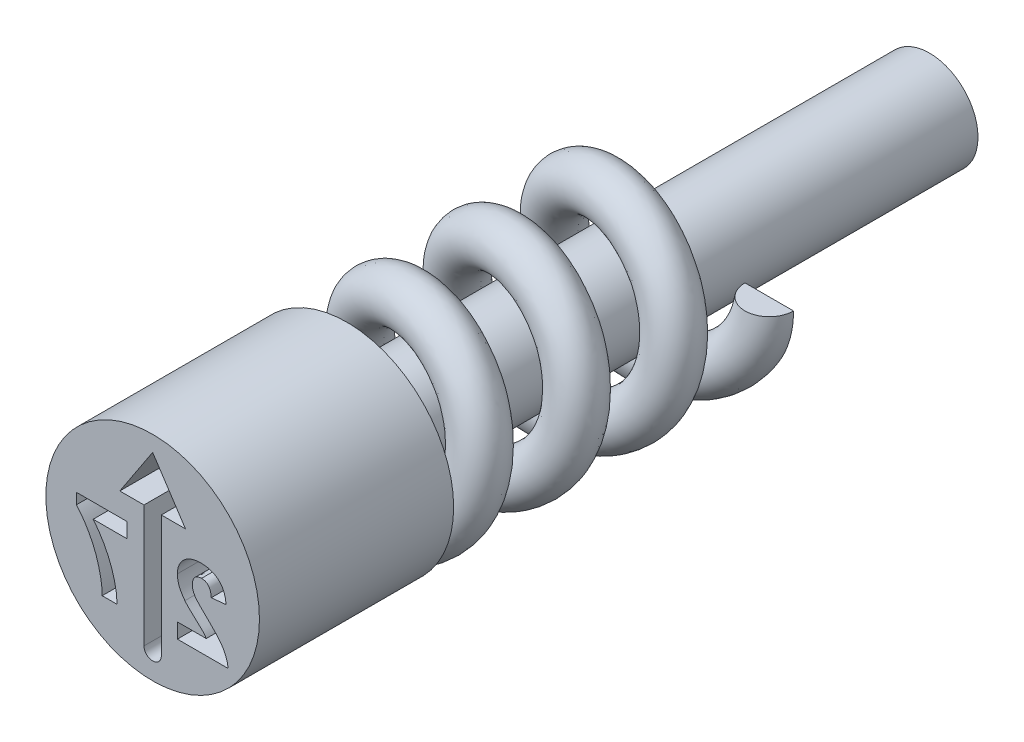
ISO-10303-21;
HEADER;
FILE_DESCRIPTION(('STEP AP214'),'2;1');
FILE_NAME('part.step','',(''),(''),'','','');
FILE_SCHEMA(('AUTOMOTIVE_DESIGN { 1 0 10303 214 1 1 1 1 }'));
ENDSEC;
DATA;
#1=APPLICATION_CONTEXT('core data for automotive mechanical design processes');
#2=APPLICATION_PROTOCOL_DEFINITION('international standard','automotive_design',2000,#1);
#3=PRODUCT_CONTEXT('',#1,'mechanical');
#4=PRODUCT('Part','Part','',(#3));
#5=PRODUCT_RELATED_PRODUCT_CATEGORY('part','',(#4));
#6=PRODUCT_DEFINITION_FORMATION('','',#4);
#7=PRODUCT_DEFINITION_CONTEXT('part definition',#1,'design');
#8=PRODUCT_DEFINITION('design','',#6,#7);
#9=PRODUCT_DEFINITION_SHAPE('','',#8);
#10=(LENGTH_UNIT() NAMED_UNIT(*) SI_UNIT(.MILLI.,.METRE.));
#11=(NAMED_UNIT(*) PLANE_ANGLE_UNIT() SI_UNIT($,.RADIAN.));
#12=(NAMED_UNIT(*) SI_UNIT($,.STERADIAN.) SOLID_ANGLE_UNIT());
#13=UNCERTAINTY_MEASURE_WITH_UNIT(LENGTH_MEASURE(1.E-05),#10,'distance_accuracy_value','');
#14=(GEOMETRIC_REPRESENTATION_CONTEXT(3) GLOBAL_UNCERTAINTY_ASSIGNED_CONTEXT((#13)) GLOBAL_UNIT_ASSIGNED_CONTEXT((#10,
#11,#12)) REPRESENTATION_CONTEXT('',''));
#15=CARTESIAN_POINT('',(0.,0.,0.));
#16=DIRECTION('',(0.,0.,1.));
#17=DIRECTION('',(1.,0.,0.));
#18=AXIS2_PLACEMENT_3D('',#15,#16,#17);
#19=CARTESIAN_POINT('',(0.85,0.,-5.75));
#20=DIRECTION('',(0.,-1.,0.));
#21=DIRECTION('',(0.,0.,-1.));
#22=AXIS2_PLACEMENT_3D('',#19,#20,#21);
#23=PLANE('',#22);
#24=CARTESIAN_POINT('',(0.85,0.,-5.5));
#25=DIRECTION('',(0.,1.,0.));
#26=DIRECTION('',(0.,0.,1.));
#27=AXIS2_PLACEMENT_3D('',#24,#25,#26);
#28=CIRCLE('',#27,0.25);
#29=CARTESIAN_POINT('',(0.6,-3.81647975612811E-13,-5.5));
#30=VERTEX_POINT('',#29);
#31=CARTESIAN_POINT('',(1.1,0.,-5.5));
#32=VERTEX_POINT('',#31);
#33=EDGE_CURVE('E88',#30,#32,#28,.T.);
#34=ORIENTED_EDGE('',*,*,#33,.T.);
#35=DIRECTION('',(-1.,0.,0.));
#36=VECTOR('',#35,1.);
#37=CARTESIAN_POINT('',(0.85,0.,-5.5));
#38=LINE('',#37,#36);
#39=EDGE_CURVE('E75',#32,#30,#38,.T.);
#40=ORIENTED_EDGE('',*,*,#39,.T.);
#41=EDGE_LOOP('',(#34,#40));
#42=FACE_BOUND('',#41,.T.);
#43=ADVANCED_FACE('F49',(#42),#23,.F.);
#44=CARTESIAN_POINT('',(-0.85,0.,-2.25));
#45=DIRECTION('',(0.,1.,0.));
#46=DIRECTION('',(-1.,0.,0.));
#47=AXIS2_PLACEMENT_3D('',#44,#45,#46);
#48=PLANE('',#47);
#49=DIRECTION('',(-1.,0.,0.));
#50=VECTOR('',#49,1.);
#51=CARTESIAN_POINT('',(-0.85,0.,-2.));
#52=LINE('',#51,#50);
#53=CARTESIAN_POINT('',(-0.6,0.,-2.));
#54=VERTEX_POINT('',#53);
#55=CARTESIAN_POINT('',(-1.1,0.,-2.));
#56=VERTEX_POINT('',#55);
#57=EDGE_CURVE('E69',#54,#56,#52,.T.);
#58=ORIENTED_EDGE('',*,*,#57,.F.);
#59=CARTESIAN_POINT('',(-0.85,0.,-2.));
#60=DIRECTION('',(0.,1.,0.));
#61=DIRECTION('',(-1.,0.,0.));
#62=AXIS2_PLACEMENT_3D('',#59,#60,#61);
#63=CIRCLE('',#62,0.25);
#64=EDGE_CURVE('E85',#54,#56,#63,.T.);
#65=ORIENTED_EDGE('',*,*,#64,.T.);
#66=EDGE_LOOP('',(#58,#65));
#67=FACE_BOUND('',#66,.T.);
#68=ADVANCED_FACE('F51',(#67),#48,.T.);
#69=CARTESIAN_POINT('',(0.85,0.,-5.25));
#70=CARTESIAN_POINT('',(0.85,-0.352081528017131,-5.1875));
#71=CARTESIAN_POINT('',(0.601040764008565,-0.601040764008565,-5.125));
#72=CARTESIAN_POINT('',(0.352081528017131,-0.85,-5.0625));
#73=CARTESIAN_POINT('',(0.,-0.85,-5.));
#74=CARTESIAN_POINT('',(-0.352081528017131,-0.85,-4.9375));
#75=CARTESIAN_POINT('',(-0.601040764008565,-0.601040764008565,-4.875));
#76=CARTESIAN_POINT('',(-0.85,-0.352081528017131,-4.8125));
#77=CARTESIAN_POINT('',(-0.85,0.,-4.75));
#78=CARTESIAN_POINT('',(-0.85,0.352081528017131,-4.6875));
#79=CARTESIAN_POINT('',(-0.601040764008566,0.601040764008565,-4.625));
#80=CARTESIAN_POINT('',(-0.352081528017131,0.85,-4.5625));
#81=CARTESIAN_POINT('',(0.,0.85,-4.5));
#82=CARTESIAN_POINT('',(0.352081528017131,0.85,-4.4375));
#83=CARTESIAN_POINT('',(0.601040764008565,0.601040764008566,-4.375));
#84=CARTESIAN_POINT('',(0.85,0.352081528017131,-4.3125));
#85=CARTESIAN_POINT('',(0.85,0.,-4.25));
#86=CARTESIAN_POINT('',(0.85,-0.352081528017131,-4.1875));
#87=CARTESIAN_POINT('',(0.601040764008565,-0.601040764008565,-4.125));
#88=CARTESIAN_POINT('',(0.352081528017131,-0.85,-4.0625));
#89=CARTESIAN_POINT('',(0.,-0.85,-4.));
#90=CARTESIAN_POINT('',(-0.352081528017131,-0.85,-3.9375));
#91=CARTESIAN_POINT('',(-0.601040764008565,-0.601040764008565,-3.875));
#92=CARTESIAN_POINT('',(-0.85,-0.352081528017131,-3.8125));
#93=CARTESIAN_POINT('',(-0.85,0.,-3.75));
#94=CARTESIAN_POINT('',(-0.85,0.352081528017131,-3.6875));
#95=CARTESIAN_POINT('',(-0.601040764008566,0.601040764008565,-3.625));
#96=CARTESIAN_POINT('',(-0.352081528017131,0.85,-3.5625));
#97=CARTESIAN_POINT('',(0.,0.85,-3.5));
#98=CARTESIAN_POINT('',(0.352081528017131,0.85,-3.4375));
#99=CARTESIAN_POINT('',(0.601040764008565,0.601040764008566,-3.375));
#100=CARTESIAN_POINT('',(0.85,0.352081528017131,-3.3125));
#101=CARTESIAN_POINT('',(0.85,0.,-3.25));
#102=CARTESIAN_POINT('',(0.85,-0.352081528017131,-3.1875));
#103=CARTESIAN_POINT('',(0.601040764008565,-0.601040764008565,-3.125));
#104=CARTESIAN_POINT('',(0.352081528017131,-0.85,-3.0625));
#105=CARTESIAN_POINT('',(0.,-0.85,-3.));
#106=CARTESIAN_POINT('',(-0.352081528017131,-0.85,-2.9375));
#107=CARTESIAN_POINT('',(-0.601040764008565,-0.601040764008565,-2.875));
#108=CARTESIAN_POINT('',(-0.85,-0.352081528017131,-2.8125));
#109=CARTESIAN_POINT('',(-0.85,0.,-2.75));
#110=CARTESIAN_POINT('',(-0.85,0.352081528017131,-2.6875));
#111=CARTESIAN_POINT('',(-0.601040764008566,0.601040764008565,-2.625));
#112=CARTESIAN_POINT('',(-0.352081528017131,0.85,-2.5625));
#113=CARTESIAN_POINT('',(0.,0.85,-2.5));
#114=CARTESIAN_POINT('',(0.352081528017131,0.85,-2.4375));
#115=CARTESIAN_POINT('',(0.601040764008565,0.601040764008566,-2.375));
#116=CARTESIAN_POINT('',(0.85,0.352081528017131,-2.3125));
#117=CARTESIAN_POINT('',(0.85,0.,-2.25));
#118=CARTESIAN_POINT('',(0.85,-0.352081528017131,-2.1875));
#119=CARTESIAN_POINT('',(0.601040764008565,-0.601040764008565,-2.125));
#120=CARTESIAN_POINT('',(0.352081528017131,-0.85,-2.0625));
#121=CARTESIAN_POINT('',(0.,-0.85,-2.));
#122=CARTESIAN_POINT('',(-0.352081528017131,-0.85,-1.9375));
#123=CARTESIAN_POINT('',(-0.601040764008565,-0.601040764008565,-1.875));
#124=CARTESIAN_POINT('',(-0.85,-0.352081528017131,-1.8125));
#125=CARTESIAN_POINT('',(-0.85,0.,-1.75));
#126=CARTESIAN_POINT('',(1.35,0.,-5.25));
#127=CARTESIAN_POINT('',(1.35,-0.559188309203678,-5.1875));
#128=CARTESIAN_POINT('',(0.954594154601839,-0.954594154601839,-5.125));
#129=CARTESIAN_POINT('',(0.559188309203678,-1.35,-5.0625));
#130=CARTESIAN_POINT('',(0.,-1.35,-5.));
#131=CARTESIAN_POINT('',(-0.559188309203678,-1.35,-4.9375));
#132=CARTESIAN_POINT('',(-0.954594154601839,-0.954594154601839,-4.875));
#133=CARTESIAN_POINT('',(-1.35,-0.559188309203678,-4.8125));
#134=CARTESIAN_POINT('',(-1.35,0.,-4.75));
#135=CARTESIAN_POINT('',(-1.35,0.559188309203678,-4.6875));
#136=CARTESIAN_POINT('',(-0.954594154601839,0.954594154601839,-4.625));
#137=CARTESIAN_POINT('',(-0.559188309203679,1.35,-4.5625));
#138=CARTESIAN_POINT('',(0.,1.35,-4.5));
#139=CARTESIAN_POINT('',(0.559188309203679,1.35,-4.4375));
#140=CARTESIAN_POINT('',(0.954594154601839,0.954594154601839,-4.375));
#141=CARTESIAN_POINT('',(1.35,0.559188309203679,-4.3125));
#142=CARTESIAN_POINT('',(1.35,0.,-4.25));
#143=CARTESIAN_POINT('',(1.35,-0.559188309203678,-4.1875));
#144=CARTESIAN_POINT('',(0.954594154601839,-0.954594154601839,-4.125));
#145=CARTESIAN_POINT('',(0.559188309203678,-1.35,-4.0625));
#146=CARTESIAN_POINT('',(0.,-1.35,-4.));
#147=CARTESIAN_POINT('',(-0.559188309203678,-1.35,-3.9375));
#148=CARTESIAN_POINT('',(-0.954594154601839,-0.954594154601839,-3.875));
#149=CARTESIAN_POINT('',(-1.35,-0.559188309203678,-3.8125));
#150=CARTESIAN_POINT('',(-1.35,0.,-3.75));
#151=CARTESIAN_POINT('',(-1.35,0.559188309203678,-3.6875));
#152=CARTESIAN_POINT('',(-0.954594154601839,0.954594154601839,-3.625));
#153=CARTESIAN_POINT('',(-0.559188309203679,1.35,-3.5625));
#154=CARTESIAN_POINT('',(0.,1.35,-3.5));
#155=CARTESIAN_POINT('',(0.559188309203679,1.35,-3.4375));
#156=CARTESIAN_POINT('',(0.954594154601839,0.954594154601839,-3.375));
#157=CARTESIAN_POINT('',(1.35,0.559188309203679,-3.3125));
#158=CARTESIAN_POINT('',(1.35,0.,-3.25));
#159=CARTESIAN_POINT('',(1.35,-0.559188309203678,-3.1875));
#160=CARTESIAN_POINT('',(0.954594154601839,-0.954594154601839,-3.125));
#161=CARTESIAN_POINT('',(0.559188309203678,-1.35,-3.0625));
#162=CARTESIAN_POINT('',(0.,-1.35,-3.));
#163=CARTESIAN_POINT('',(-0.559188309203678,-1.35,-2.9375));
#164=CARTESIAN_POINT('',(-0.954594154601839,-0.954594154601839,-2.875));
#165=CARTESIAN_POINT('',(-1.35,-0.559188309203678,-2.8125));
#166=CARTESIAN_POINT('',(-1.35,0.,-2.75));
#167=CARTESIAN_POINT('',(-1.35,0.559188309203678,-2.6875));
#168=CARTESIAN_POINT('',(-0.954594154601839,0.954594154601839,-2.625));
#169=CARTESIAN_POINT('',(-0.559188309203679,1.35,-2.5625));
#170=CARTESIAN_POINT('',(0.,1.35,-2.5));
#171=CARTESIAN_POINT('',(0.559188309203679,1.35,-2.4375));
#172=CARTESIAN_POINT('',(0.954594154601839,0.954594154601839,-2.375));
#173=CARTESIAN_POINT('',(1.35,0.559188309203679,-2.3125));
#174=CARTESIAN_POINT('',(1.35,0.,-2.25));
#175=CARTESIAN_POINT('',(1.35,-0.559188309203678,-2.1875));
#176=CARTESIAN_POINT('',(0.954594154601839,-0.954594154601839,-2.125));
#177=CARTESIAN_POINT('',(0.559188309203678,-1.35,-2.0625));
#178=CARTESIAN_POINT('',(0.,-1.35,-2.));
#179=CARTESIAN_POINT('',(-0.559188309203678,-1.35,-1.9375));
#180=CARTESIAN_POINT('',(-0.954594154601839,-0.954594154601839,-1.875));
#181=CARTESIAN_POINT('',(-1.35,-0.559188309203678,-1.8125));
#182=CARTESIAN_POINT('',(-1.35,0.,-1.75));
#183=CARTESIAN_POINT('',(1.35,0.,-5.75));
#184=CARTESIAN_POINT('',(1.35,-0.559188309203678,-5.6875));
#185=CARTESIAN_POINT('',(0.954594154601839,-0.954594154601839,-5.625));
#186=CARTESIAN_POINT('',(0.559188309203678,-1.35,-5.5625));
#187=CARTESIAN_POINT('',(0.,-1.35,-5.5));
#188=CARTESIAN_POINT('',(-0.559188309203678,-1.35,-5.4375));
#189=CARTESIAN_POINT('',(-0.954594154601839,-0.954594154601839,-5.375));
#190=CARTESIAN_POINT('',(-1.35,-0.559188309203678,-5.3125));
#191=CARTESIAN_POINT('',(-1.35,0.,-5.25));
#192=CARTESIAN_POINT('',(-1.35,0.559188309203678,-5.1875));
#193=CARTESIAN_POINT('',(-0.954594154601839,0.954594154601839,-5.125));
#194=CARTESIAN_POINT('',(-0.559188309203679,1.35,-5.0625));
#195=CARTESIAN_POINT('',(0.,1.35,-5.));
#196=CARTESIAN_POINT('',(0.559188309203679,1.35,-4.9375));
#197=CARTESIAN_POINT('',(0.954594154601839,0.954594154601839,-4.875));
#198=CARTESIAN_POINT('',(1.35,0.559188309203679,-4.8125));
#199=CARTESIAN_POINT('',(1.35,0.,-4.75));
#200=CARTESIAN_POINT('',(1.35,-0.559188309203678,-4.6875));
#201=CARTESIAN_POINT('',(0.954594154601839,-0.954594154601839,-4.625));
#202=CARTESIAN_POINT('',(0.559188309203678,-1.35,-4.5625));
#203=CARTESIAN_POINT('',(0.,-1.35,-4.5));
#204=CARTESIAN_POINT('',(-0.559188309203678,-1.35,-4.4375));
#205=CARTESIAN_POINT('',(-0.954594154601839,-0.954594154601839,-4.375));
#206=CARTESIAN_POINT('',(-1.35,-0.559188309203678,-4.3125));
#207=CARTESIAN_POINT('',(-1.35,0.,-4.25));
#208=CARTESIAN_POINT('',(-1.35,0.559188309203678,-4.1875));
#209=CARTESIAN_POINT('',(-0.954594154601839,0.954594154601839,-4.125));
#210=CARTESIAN_POINT('',(-0.559188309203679,1.35,-4.0625));
#211=CARTESIAN_POINT('',(0.,1.35,-4.));
#212=CARTESIAN_POINT('',(0.559188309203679,1.35,-3.9375));
#213=CARTESIAN_POINT('',(0.954594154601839,0.954594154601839,-3.875));
#214=CARTESIAN_POINT('',(1.35,0.559188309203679,-3.8125));
#215=CARTESIAN_POINT('',(1.35,0.,-3.75));
#216=CARTESIAN_POINT('',(1.35,-0.559188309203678,-3.6875));
#217=CARTESIAN_POINT('',(0.954594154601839,-0.954594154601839,-3.625));
#218=CARTESIAN_POINT('',(0.559188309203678,-1.35,-3.5625));
#219=CARTESIAN_POINT('',(0.,-1.35,-3.5));
#220=CARTESIAN_POINT('',(-0.559188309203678,-1.35,-3.4375));
#221=CARTESIAN_POINT('',(-0.954594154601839,-0.954594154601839,-3.375));
#222=CARTESIAN_POINT('',(-1.35,-0.559188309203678,-3.3125));
#223=CARTESIAN_POINT('',(-1.35,0.,-3.25));
#224=CARTESIAN_POINT('',(-1.35,0.559188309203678,-3.1875));
#225=CARTESIAN_POINT('',(-0.954594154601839,0.954594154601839,-3.125));
#226=CARTESIAN_POINT('',(-0.559188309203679,1.35,-3.0625));
#227=CARTESIAN_POINT('',(0.,1.35,-3.));
#228=CARTESIAN_POINT('',(0.559188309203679,1.35,-2.9375));
#229=CARTESIAN_POINT('',(0.954594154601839,0.954594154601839,-2.875));
#230=CARTESIAN_POINT('',(1.35,0.559188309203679,-2.8125));
#231=CARTESIAN_POINT('',(1.35,0.,-2.75));
#232=CARTESIAN_POINT('',(1.35,-0.559188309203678,-2.6875));
#233=CARTESIAN_POINT('',(0.954594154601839,-0.954594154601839,-2.625));
#234=CARTESIAN_POINT('',(0.559188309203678,-1.35,-2.5625));
#235=CARTESIAN_POINT('',(0.,-1.35,-2.5));
#236=CARTESIAN_POINT('',(-0.559188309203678,-1.35,-2.4375));
#237=CARTESIAN_POINT('',(-0.954594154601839,-0.954594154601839,-2.375));
#238=CARTESIAN_POINT('',(-1.35,-0.559188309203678,-2.3125));
#239=CARTESIAN_POINT('',(-1.35,0.,-2.25));
#240=CARTESIAN_POINT('',(0.85,0.,-5.75));
#241=CARTESIAN_POINT('',(0.85,-0.352081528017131,-5.6875));
#242=CARTESIAN_POINT('',(0.601040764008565,-0.601040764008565,-5.625));
#243=CARTESIAN_POINT('',(0.352081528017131,-0.85,-5.5625));
#244=CARTESIAN_POINT('',(0.,-0.85,-5.5));
#245=CARTESIAN_POINT('',(-0.352081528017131,-0.85,-5.4375));
#246=CARTESIAN_POINT('',(-0.601040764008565,-0.601040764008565,-5.375));
#247=CARTESIAN_POINT('',(-0.85,-0.352081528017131,-5.3125));
#248=CARTESIAN_POINT('',(-0.85,0.,-5.25));
#249=CARTESIAN_POINT('',(-0.85,0.352081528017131,-5.1875));
#250=CARTESIAN_POINT('',(-0.601040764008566,0.601040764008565,-5.125));
#251=CARTESIAN_POINT('',(-0.352081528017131,0.85,-5.0625));
#252=CARTESIAN_POINT('',(0.,0.85,-5.));
#253=CARTESIAN_POINT('',(0.352081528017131,0.85,-4.9375));
#254=CARTESIAN_POINT('',(0.601040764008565,0.601040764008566,-4.875));
#255=CARTESIAN_POINT('',(0.85,0.352081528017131,-4.8125));
#256=CARTESIAN_POINT('',(0.85,0.,-4.75));
#257=CARTESIAN_POINT('',(0.85,-0.352081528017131,-4.6875));
#258=CARTESIAN_POINT('',(0.601040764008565,-0.601040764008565,-4.625));
#259=CARTESIAN_POINT('',(0.352081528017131,-0.85,-4.5625));
#260=CARTESIAN_POINT('',(0.,-0.85,-4.5));
#261=CARTESIAN_POINT('',(-0.352081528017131,-0.85,-4.4375));
#262=CARTESIAN_POINT('',(-0.601040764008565,-0.601040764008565,-4.375));
#263=CARTESIAN_POINT('',(-0.85,-0.352081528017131,-4.3125));
#264=CARTESIAN_POINT('',(-0.85,0.,-4.25));
#265=CARTESIAN_POINT('',(-0.85,0.352081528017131,-4.1875));
#266=CARTESIAN_POINT('',(-0.601040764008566,0.601040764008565,-4.125));
#267=CARTESIAN_POINT('',(-0.352081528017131,0.85,-4.0625));
#268=CARTESIAN_POINT('',(0.,0.85,-4.));
#269=CARTESIAN_POINT('',(0.352081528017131,0.85,-3.9375));
#270=CARTESIAN_POINT('',(0.601040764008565,0.601040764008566,-3.875));
#271=CARTESIAN_POINT('',(0.85,0.352081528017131,-3.8125));
#272=CARTESIAN_POINT('',(0.85,0.,-3.75));
#273=CARTESIAN_POINT('',(0.85,-0.352081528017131,-3.6875));
#274=CARTESIAN_POINT('',(0.601040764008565,-0.601040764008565,-3.625));
#275=CARTESIAN_POINT('',(0.352081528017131,-0.85,-3.5625));
#276=CARTESIAN_POINT('',(0.,-0.85,-3.5));
#277=CARTESIAN_POINT('',(-0.352081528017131,-0.85,-3.4375));
#278=CARTESIAN_POINT('',(-0.601040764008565,-0.601040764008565,-3.375));
#279=CARTESIAN_POINT('',(-0.85,-0.352081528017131,-3.3125));
#280=CARTESIAN_POINT('',(-0.85,0.,-3.25));
#281=CARTESIAN_POINT('',(-0.85,0.352081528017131,-3.1875));
#282=CARTESIAN_POINT('',(-0.601040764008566,0.601040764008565,-3.125));
#283=CARTESIAN_POINT('',(-0.352081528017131,0.85,-3.0625));
#284=CARTESIAN_POINT('',(0.,0.85,-3.));
#285=CARTESIAN_POINT('',(0.352081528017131,0.85,-2.9375));
#286=CARTESIAN_POINT('',(0.601040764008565,0.601040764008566,-2.875));
#287=CARTESIAN_POINT('',(0.85,0.352081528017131,-2.8125));
#288=CARTESIAN_POINT('',(0.85,0.,-2.75));
#289=CARTESIAN_POINT('',(0.85,-0.352081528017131,-2.6875));
#290=CARTESIAN_POINT('',(0.601040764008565,-0.601040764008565,-2.625));
#291=CARTESIAN_POINT('',(0.352081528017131,-0.85,-2.5625));
#292=CARTESIAN_POINT('',(0.,-0.85,-2.5));
#293=CARTESIAN_POINT('',(-0.352081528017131,-0.85,-2.4375));
#294=CARTESIAN_POINT('',(-0.601040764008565,-0.601040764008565,-2.375));
#295=CARTESIAN_POINT('',(-0.85,-0.352081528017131,-2.3125));
#296=CARTESIAN_POINT('',(-0.85,0.,-2.25));
#297=CARTESIAN_POINT('',(0.35,0.,-5.75));
#298=CARTESIAN_POINT('',(0.35,-0.144974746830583,-5.6875));
#299=CARTESIAN_POINT('',(0.247487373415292,-0.247487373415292,-5.625));
#300=CARTESIAN_POINT('',(0.144974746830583,-0.35,-5.5625));
#301=CARTESIAN_POINT('',(0.,-0.35,-5.5));
#302=CARTESIAN_POINT('',(-0.144974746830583,-0.35,-5.4375));
#303=CARTESIAN_POINT('',(-0.247487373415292,-0.247487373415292,-5.375));
#304=CARTESIAN_POINT('',(-0.35,-0.144974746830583,-5.3125));
#305=CARTESIAN_POINT('',(-0.35,0.,-5.25));
#306=CARTESIAN_POINT('',(-0.35,0.144974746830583,-5.1875));
#307=CARTESIAN_POINT('',(-0.247487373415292,0.247487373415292,-5.125));
#308=CARTESIAN_POINT('',(-0.144974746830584,0.35,-5.0625));
#309=CARTESIAN_POINT('',(0.,0.35,-5.));
#310=CARTESIAN_POINT('',(0.144974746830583,0.35,-4.9375));
#311=CARTESIAN_POINT('',(0.247487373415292,0.247487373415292,-4.875));
#312=CARTESIAN_POINT('',(0.35,0.144974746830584,-4.8125));
#313=CARTESIAN_POINT('',(0.35,0.,-4.75));
#314=CARTESIAN_POINT('',(0.35,-0.144974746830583,-4.6875));
#315=CARTESIAN_POINT('',(0.247487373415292,-0.247487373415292,-4.625));
#316=CARTESIAN_POINT('',(0.144974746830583,-0.35,-4.5625));
#317=CARTESIAN_POINT('',(0.,-0.35,-4.5));
#318=CARTESIAN_POINT('',(-0.144974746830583,-0.35,-4.4375));
#319=CARTESIAN_POINT('',(-0.247487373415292,-0.247487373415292,-4.375));
#320=CARTESIAN_POINT('',(-0.35,-0.144974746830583,-4.3125));
#321=CARTESIAN_POINT('',(-0.35,0.,-4.25));
#322=CARTESIAN_POINT('',(-0.35,0.144974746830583,-4.1875));
#323=CARTESIAN_POINT('',(-0.247487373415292,0.247487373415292,-4.125));
#324=CARTESIAN_POINT('',(-0.144974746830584,0.35,-4.0625));
#325=CARTESIAN_POINT('',(0.,0.35,-4.));
#326=CARTESIAN_POINT('',(0.144974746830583,0.35,-3.9375));
#327=CARTESIAN_POINT('',(0.247487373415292,0.247487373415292,-3.875));
#328=CARTESIAN_POINT('',(0.35,0.144974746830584,-3.8125));
#329=CARTESIAN_POINT('',(0.35,0.,-3.75));
#330=CARTESIAN_POINT('',(0.35,-0.144974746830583,-3.6875));
#331=CARTESIAN_POINT('',(0.247487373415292,-0.247487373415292,-3.625));
#332=CARTESIAN_POINT('',(0.144974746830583,-0.35,-3.5625));
#333=CARTESIAN_POINT('',(0.,-0.35,-3.5));
#334=CARTESIAN_POINT('',(-0.144974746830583,-0.35,-3.4375));
#335=CARTESIAN_POINT('',(-0.247487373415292,-0.247487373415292,-3.375));
#336=CARTESIAN_POINT('',(-0.35,-0.144974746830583,-3.3125));
#337=CARTESIAN_POINT('',(-0.35,0.,-3.25));
#338=CARTESIAN_POINT('',(-0.35,0.144974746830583,-3.1875));
#339=CARTESIAN_POINT('',(-0.247487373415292,0.247487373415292,-3.125));
#340=CARTESIAN_POINT('',(-0.144974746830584,0.35,-3.0625));
#341=CARTESIAN_POINT('',(0.,0.35,-3.));
#342=CARTESIAN_POINT('',(0.144974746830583,0.35,-2.9375));
#343=CARTESIAN_POINT('',(0.247487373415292,0.247487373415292,-2.875));
#344=CARTESIAN_POINT('',(0.35,0.144974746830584,-2.8125));
#345=CARTESIAN_POINT('',(0.35,0.,-2.75));
#346=CARTESIAN_POINT('',(0.35,-0.144974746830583,-2.6875));
#347=CARTESIAN_POINT('',(0.247487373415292,-0.247487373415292,-2.625));
#348=CARTESIAN_POINT('',(0.144974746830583,-0.35,-2.5625));
#349=CARTESIAN_POINT('',(0.,-0.35,-2.5));
#350=CARTESIAN_POINT('',(-0.144974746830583,-0.35,-2.4375));
#351=CARTESIAN_POINT('',(-0.247487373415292,-0.247487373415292,-2.375));
#352=CARTESIAN_POINT('',(-0.35,-0.144974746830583,-2.3125));
#353=CARTESIAN_POINT('',(-0.35,0.,-2.25));
#354=CARTESIAN_POINT('',(0.35,0.,-5.25));
#355=CARTESIAN_POINT('',(0.35,-0.144974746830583,-5.1875));
#356=CARTESIAN_POINT('',(0.247487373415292,-0.247487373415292,-5.125));
#357=CARTESIAN_POINT('',(0.144974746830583,-0.35,-5.0625));
#358=CARTESIAN_POINT('',(0.,-0.35,-5.));
#359=CARTESIAN_POINT('',(-0.144974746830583,-0.35,-4.9375));
#360=CARTESIAN_POINT('',(-0.247487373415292,-0.247487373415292,-4.875));
#361=CARTESIAN_POINT('',(-0.35,-0.144974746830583,-4.8125));
#362=CARTESIAN_POINT('',(-0.35,0.,-4.75));
#363=CARTESIAN_POINT('',(-0.35,0.144974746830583,-4.6875));
#364=CARTESIAN_POINT('',(-0.247487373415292,0.247487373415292,-4.625));
#365=CARTESIAN_POINT('',(-0.144974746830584,0.35,-4.5625));
#366=CARTESIAN_POINT('',(0.,0.35,-4.5));
#367=CARTESIAN_POINT('',(0.144974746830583,0.35,-4.4375));
#368=CARTESIAN_POINT('',(0.247487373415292,0.247487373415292,-4.375));
#369=CARTESIAN_POINT('',(0.35,0.144974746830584,-4.3125));
#370=CARTESIAN_POINT('',(0.35,0.,-4.25));
#371=CARTESIAN_POINT('',(0.35,-0.144974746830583,-4.1875));
#372=CARTESIAN_POINT('',(0.247487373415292,-0.247487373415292,-4.125));
#373=CARTESIAN_POINT('',(0.144974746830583,-0.35,-4.0625));
#374=CARTESIAN_POINT('',(0.,-0.35,-4.));
#375=CARTESIAN_POINT('',(-0.144974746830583,-0.35,-3.9375));
#376=CARTESIAN_POINT('',(-0.247487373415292,-0.247487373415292,-3.875));
#377=CARTESIAN_POINT('',(-0.35,-0.144974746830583,-3.8125));
#378=CARTESIAN_POINT('',(-0.35,0.,-3.75));
#379=CARTESIAN_POINT('',(-0.35,0.144974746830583,-3.6875));
#380=CARTESIAN_POINT('',(-0.247487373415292,0.247487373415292,-3.625));
#381=CARTESIAN_POINT('',(-0.144974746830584,0.35,-3.5625));
#382=CARTESIAN_POINT('',(0.,0.35,-3.5));
#383=CARTESIAN_POINT('',(0.144974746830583,0.35,-3.4375));
#384=CARTESIAN_POINT('',(0.247487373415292,0.247487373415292,-3.375));
#385=CARTESIAN_POINT('',(0.35,0.144974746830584,-3.3125));
#386=CARTESIAN_POINT('',(0.35,0.,-3.25));
#387=CARTESIAN_POINT('',(0.35,-0.144974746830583,-3.1875));
#388=CARTESIAN_POINT('',(0.247487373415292,-0.247487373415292,-3.125));
#389=CARTESIAN_POINT('',(0.144974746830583,-0.35,-3.0625));
#390=CARTESIAN_POINT('',(0.,-0.35,-3.));
#391=CARTESIAN_POINT('',(-0.144974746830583,-0.35,-2.9375));
#392=CARTESIAN_POINT('',(-0.247487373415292,-0.247487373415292,-2.875));
#393=CARTESIAN_POINT('',(-0.35,-0.144974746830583,-2.8125));
#394=CARTESIAN_POINT('',(-0.35,0.,-2.75));
#395=CARTESIAN_POINT('',(-0.35,0.144974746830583,-2.6875));
#396=CARTESIAN_POINT('',(-0.247487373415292,0.247487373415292,-2.625));
#397=CARTESIAN_POINT('',(-0.144974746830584,0.35,-2.5625));
#398=CARTESIAN_POINT('',(0.,0.35,-2.5));
#399=CARTESIAN_POINT('',(0.144974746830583,0.35,-2.4375));
#400=CARTESIAN_POINT('',(0.247487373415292,0.247487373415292,-2.375));
#401=CARTESIAN_POINT('',(0.35,0.144974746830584,-2.3125));
#402=CARTESIAN_POINT('',(0.35,0.,-2.25));
#403=CARTESIAN_POINT('',(0.35,-0.144974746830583,-2.1875));
#404=CARTESIAN_POINT('',(0.247487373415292,-0.247487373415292,-2.125));
#405=CARTESIAN_POINT('',(0.144974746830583,-0.35,-2.0625));
#406=CARTESIAN_POINT('',(0.,-0.35,-2.));
#407=CARTESIAN_POINT('',(-0.144974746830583,-0.35,-1.9375));
#408=CARTESIAN_POINT('',(-0.247487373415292,-0.247487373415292,-1.875));
#409=CARTESIAN_POINT('',(-0.35,-0.144974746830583,-1.8125));
#410=CARTESIAN_POINT('',(-0.35,0.,-1.75));
#411=CARTESIAN_POINT('',(0.85,0.,-5.25));
#412=CARTESIAN_POINT('',(0.85,-0.352081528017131,-5.1875));
#413=CARTESIAN_POINT('',(0.601040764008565,-0.601040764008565,-5.125));
#414=CARTESIAN_POINT('',(0.352081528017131,-0.85,-5.0625));
#415=CARTESIAN_POINT('',(0.,-0.85,-5.));
#416=CARTESIAN_POINT('',(-0.352081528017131,-0.85,-4.9375));
#417=CARTESIAN_POINT('',(-0.601040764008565,-0.601040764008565,-4.875));
#418=CARTESIAN_POINT('',(-0.85,-0.352081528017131,-4.8125));
#419=CARTESIAN_POINT('',(-0.85,0.,-4.75));
#420=CARTESIAN_POINT('',(-0.85,0.352081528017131,-4.6875));
#421=CARTESIAN_POINT('',(-0.601040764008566,0.601040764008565,-4.625));
#422=CARTESIAN_POINT('',(-0.352081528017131,0.85,-4.5625));
#423=CARTESIAN_POINT('',(0.,0.85,-4.5));
#424=CARTESIAN_POINT('',(0.352081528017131,0.85,-4.4375));
#425=CARTESIAN_POINT('',(0.601040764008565,0.601040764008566,-4.375));
#426=CARTESIAN_POINT('',(0.85,0.352081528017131,-4.3125));
#427=CARTESIAN_POINT('',(0.85,0.,-4.25));
#428=CARTESIAN_POINT('',(0.85,-0.352081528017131,-4.1875));
#429=CARTESIAN_POINT('',(0.601040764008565,-0.601040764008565,-4.125));
#430=CARTESIAN_POINT('',(0.352081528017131,-0.85,-4.0625));
#431=CARTESIAN_POINT('',(0.,-0.85,-4.));
#432=CARTESIAN_POINT('',(-0.352081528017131,-0.85,-3.9375));
#433=CARTESIAN_POINT('',(-0.601040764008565,-0.601040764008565,-3.875));
#434=CARTESIAN_POINT('',(-0.85,-0.352081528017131,-3.8125));
#435=CARTESIAN_POINT('',(-0.85,0.,-3.75));
#436=CARTESIAN_POINT('',(-0.85,0.352081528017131,-3.6875));
#437=CARTESIAN_POINT('',(-0.601040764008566,0.601040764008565,-3.625));
#438=CARTESIAN_POINT('',(-0.352081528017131,0.85,-3.5625));
#439=CARTESIAN_POINT('',(0.,0.85,-3.5));
#440=CARTESIAN_POINT('',(0.352081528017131,0.85,-3.4375));
#441=CARTESIAN_POINT('',(0.601040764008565,0.601040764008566,-3.375));
#442=CARTESIAN_POINT('',(0.85,0.352081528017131,-3.3125));
#443=CARTESIAN_POINT('',(0.85,0.,-3.25));
#444=CARTESIAN_POINT('',(0.85,-0.352081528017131,-3.1875));
#445=CARTESIAN_POINT('',(0.601040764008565,-0.601040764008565,-3.125));
#446=CARTESIAN_POINT('',(0.352081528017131,-0.85,-3.0625));
#447=CARTESIAN_POINT('',(0.,-0.85,-3.));
#448=CARTESIAN_POINT('',(-0.352081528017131,-0.85,-2.9375));
#449=CARTESIAN_POINT('',(-0.601040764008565,-0.601040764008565,-2.875));
#450=CARTESIAN_POINT('',(-0.85,-0.352081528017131,-2.8125));
#451=CARTESIAN_POINT('',(-0.85,0.,-2.75));
#452=CARTESIAN_POINT('',(-0.85,0.352081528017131,-2.6875));
#453=CARTESIAN_POINT('',(-0.601040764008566,0.601040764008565,-2.625));
#454=CARTESIAN_POINT('',(-0.352081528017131,0.85,-2.5625));
#455=CARTESIAN_POINT('',(0.,0.85,-2.5));
#456=CARTESIAN_POINT('',(0.352081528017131,0.85,-2.4375));
#457=CARTESIAN_POINT('',(0.601040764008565,0.601040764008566,-2.375));
#458=CARTESIAN_POINT('',(0.85,0.352081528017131,-2.3125));
#459=CARTESIAN_POINT('',(0.85,0.,-2.25));
#460=CARTESIAN_POINT('',(0.85,-0.352081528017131,-2.1875));
#461=CARTESIAN_POINT('',(0.601040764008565,-0.601040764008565,-2.125));
#462=CARTESIAN_POINT('',(0.352081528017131,-0.85,-2.0625));
#463=CARTESIAN_POINT('',(0.,-0.85,-2.));
#464=CARTESIAN_POINT('',(-0.352081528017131,-0.85,-1.9375));
#465=CARTESIAN_POINT('',(-0.601040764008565,-0.601040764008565,-1.875));
#466=CARTESIAN_POINT('',(-0.85,-0.352081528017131,-1.8125));
#467=CARTESIAN_POINT('',(-0.85,0.,-1.75));
#468=(BOUNDED_SURFACE() B_SPLINE_SURFACE(3,2,((#69,#70,#71,#72,#73,#74,#75,#76,#77,#78,#79,#80,
#81,#82,#83,#84,#85,#86,#87,#88,#89,#90,#91,#92,#93,#94,#95,#96,#97,#98,#99,#100,#101,#102,#103,
#104,#105,#106,#107,#108,#109,#110,#111,#112,#113,#114,#115,#116,#117,#118,#119,#120,#121,#122,
#123,#124,#125),(#126,#127,#128,#129,#130,#131,#132,#133,#134,#135,#136,#137,#138,#139,#140,
#141,#142,#143,#144,#145,#146,#147,#148,#149,#150,#151,#152,#153,#154,#155,#156,#157,#158,#159,
#160,#161,#162,#163,#164,#165,#166,#167,#168,#169,#170,#171,#172,#173,#174,#175,#176,#177,#178,
#179,#180,#181,#182),(#183,#184,#185,#186,#187,#188,#189,#190,#191,#192,#193,#194,#195,#196,
#197,#198,#199,#200,#201,#202,#203,#204,#205,#206,#207,#208,#209,#210,#211,#212,#213,#214,#215,
#216,#217,#218,#219,#220,#221,#222,#223,#224,#225,#226,#227,#228,#229,#230,#231,#232,#233,#234,
#235,#236,#237,#238,#239),(#240,#241,#242,#243,#244,#245,#246,#247,#248,#249,#250,#251,#252,
#253,#254,#255,#256,#257,#258,#259,#260,#261,#262,#263,#264,#265,#266,#267,#268,#269,#270,#271,
#272,#273,#274,#275,#276,#277,#278,#279,#280,#281,#282,#283,#284,#285,#286,#287,#288,#289,#290,
#291,#292,#293,#294,#295,#296),(#297,#298,#299,#300,#301,#302,#303,#304,#305,#306,#307,#308,
#309,#310,#311,#312,#313,#314,#315,#316,#317,#318,#319,#320,#321,#322,#323,#324,#325,#326,#327,
#328,#329,#330,#331,#332,#333,#334,#335,#336,#337,#338,#339,#340,#341,#342,#343,#344,#345,#346,
#347,#348,#349,#350,#351,#352,#353),(#354,#355,#356,#357,#358,#359,#360,#361,#362,#363,#364,
#365,#366,#367,#368,#369,#370,#371,#372,#373,#374,#375,#376,#377,#378,#379,#380,#381,#382,#383,
#384,#385,#386,#387,#388,#389,#390,#391,#392,#393,#394,#395,#396,#397,#398,#399,#400,#401,#402,
#403,#404,#405,#406,#407,#408,#409,#410),(#411,#412,#413,#414,#415,#416,#417,#418,#419,#420,
#421,#422,#423,#424,#425,#426,#427,#428,#429,#430,#431,#432,#433,#434,#435,#436,#437,#438,#439,
#440,#441,#442,#443,#444,#445,#446,#447,#448,#449,#450,#451,#452,#453,#454,#455,#456,#457,#458,
#459,#460,#461,#462,#463,#464,#465,#466,#467)),.UNSPECIFIED.,.T.,.F.,
.F.) B_SPLINE_SURFACE_WITH_KNOTS((4,3,4),(3,2,2,2,2,2,2,2,2,2,2,2,2,2,2,2,2,2,2,2,2,2,2,2,2,2,2,
2,3),(0.,0.5,1.),(0.,0.03125,0.0625,0.09375,0.125,0.15625,0.1875,0.21875,0.25,0.28125,0.3125,
0.34375,0.375,0.40625,0.4375,0.46875,0.5,0.53125,0.5625,0.59375,0.625,0.65625,0.6875,0.71875,
0.75,0.78125,0.8125,0.84375,0.875),
.UNSPECIFIED.) GEOMETRIC_REPRESENTATION_ITEM() RATIONAL_B_SPLINE_SURFACE(((1.,0.923879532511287,
1.,0.923879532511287,1.,0.923879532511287,1.,0.923879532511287,1.,0.923879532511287,1.,
0.923879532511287,1.,0.923879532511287,1.,0.923879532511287,1.,0.923879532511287,1.,
0.923879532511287,1.,0.923879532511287,1.,0.923879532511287,1.,0.923879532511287,1.,
0.923879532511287,1.,0.923879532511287,1.,0.923879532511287,1.,0.923879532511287,1.,
0.923879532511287,1.,0.923879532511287,1.,0.923879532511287,1.,0.923879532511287,1.,
0.923879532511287,1.,0.923879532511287,1.,0.923879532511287,1.,0.923879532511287,1.,
0.923879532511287,1.,0.923879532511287,1.,0.923879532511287,1.),(0.333333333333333,
0.307959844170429,0.333333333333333,0.307959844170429,0.333333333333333,0.307959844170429,
0.333333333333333,0.307959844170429,0.333333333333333,0.307959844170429,0.333333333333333,
0.307959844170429,0.333333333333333,0.307959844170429,0.333333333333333,0.307959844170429,
0.333333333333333,0.307959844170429,0.333333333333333,0.307959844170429,0.333333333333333,
0.307959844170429,0.333333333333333,0.307959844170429,0.333333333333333,0.307959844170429,
0.333333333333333,0.307959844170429,0.333333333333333,0.307959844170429,0.333333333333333,
0.307959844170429,0.333333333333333,0.307959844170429,0.333333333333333,0.307959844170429,
0.333333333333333,0.307959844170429,0.333333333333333,0.307959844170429,0.333333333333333,
0.307959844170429,0.333333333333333,0.307959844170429,0.333333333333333,0.307959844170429,
0.333333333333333,0.307959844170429,0.333333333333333,0.307959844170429,0.333333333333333,
0.307959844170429,0.333333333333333,0.307959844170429,0.333333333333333,0.307959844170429,
0.333333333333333),(0.333333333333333,0.307959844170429,0.333333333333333,0.307959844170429,
0.333333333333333,0.307959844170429,0.333333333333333,0.307959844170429,0.333333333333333,
0.307959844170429,0.333333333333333,0.307959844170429,0.333333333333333,0.307959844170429,
0.333333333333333,0.307959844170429,0.333333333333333,0.307959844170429,0.333333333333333,
0.307959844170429,0.333333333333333,0.307959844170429,0.333333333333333,0.307959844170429,
0.333333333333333,0.307959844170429,0.333333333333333,0.307959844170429,0.333333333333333,
0.307959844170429,0.333333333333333,0.307959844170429,0.333333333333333,0.307959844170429,
0.333333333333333,0.307959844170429,0.333333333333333,0.307959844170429,0.333333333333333,
0.307959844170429,0.333333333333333,0.307959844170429,0.333333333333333,0.307959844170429,
0.333333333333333,0.307959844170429,0.333333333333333,0.307959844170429,0.333333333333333,
0.307959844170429,0.333333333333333,0.307959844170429,0.333333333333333,0.307959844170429,
0.333333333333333,0.307959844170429,0.333333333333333),(1.,0.923879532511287,1.,
0.923879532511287,1.,0.923879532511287,1.,0.923879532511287,1.,0.923879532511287,1.,
0.923879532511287,1.,0.923879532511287,1.,0.923879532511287,1.,0.923879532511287,1.,
0.923879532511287,1.,0.923879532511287,1.,0.923879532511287,1.,0.923879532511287,1.,
0.923879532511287,1.,0.923879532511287,1.,0.923879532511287,1.,0.923879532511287,1.,
0.923879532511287,1.,0.923879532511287,1.,0.923879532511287,1.,0.923879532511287,1.,
0.923879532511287,1.,0.923879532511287,1.,0.923879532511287,1.,0.923879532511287,1.,
0.923879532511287,1.,0.923879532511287,1.,0.923879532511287,1.),(0.333333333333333,
0.307959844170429,0.333333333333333,0.307959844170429,0.333333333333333,0.307959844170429,
0.333333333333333,0.307959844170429,0.333333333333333,0.307959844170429,0.333333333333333,
0.307959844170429,0.333333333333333,0.307959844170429,0.333333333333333,0.307959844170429,
0.333333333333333,0.307959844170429,0.333333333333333,0.307959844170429,0.333333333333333,
0.307959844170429,0.333333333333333,0.307959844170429,0.333333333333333,0.307959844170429,
0.333333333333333,0.307959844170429,0.333333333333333,0.307959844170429,0.333333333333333,
0.307959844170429,0.333333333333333,0.307959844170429,0.333333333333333,0.307959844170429,
0.333333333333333,0.307959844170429,0.333333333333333,0.307959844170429,0.333333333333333,
0.307959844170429,0.333333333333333,0.307959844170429,0.333333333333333,0.307959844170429,
0.333333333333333,0.307959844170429,0.333333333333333,0.307959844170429,0.333333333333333,
0.307959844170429,0.333333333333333,0.307959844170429,0.333333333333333,0.307959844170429,
0.333333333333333),(0.333333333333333,0.307959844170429,0.333333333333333,0.307959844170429,
0.333333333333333,0.307959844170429,0.333333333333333,0.307959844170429,0.333333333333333,
0.307959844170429,0.333333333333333,0.307959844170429,0.333333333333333,0.307959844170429,
0.333333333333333,0.307959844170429,0.333333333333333,0.307959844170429,0.333333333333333,
0.307959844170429,0.333333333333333,0.307959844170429,0.333333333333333,0.307959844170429,
0.333333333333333,0.307959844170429,0.333333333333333,0.307959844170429,0.333333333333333,
0.307959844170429,0.333333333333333,0.307959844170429,0.333333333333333,0.307959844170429,
0.333333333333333,0.307959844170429,0.333333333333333,0.307959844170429,0.333333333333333,
0.307959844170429,0.333333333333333,0.307959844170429,0.333333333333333,0.307959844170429,
0.333333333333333,0.307959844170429,0.333333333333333,0.307959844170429,0.333333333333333,
0.307959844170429,0.333333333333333,0.307959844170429,0.333333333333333,0.307959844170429,
0.333333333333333,0.307959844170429,0.333333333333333),(1.,0.923879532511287,1.,
0.923879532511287,1.,0.923879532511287,1.,0.923879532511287,1.,0.923879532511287,1.,
0.923879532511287,1.,0.923879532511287,1.,0.923879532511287,1.,0.923879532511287,1.,
0.923879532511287,1.,0.923879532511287,1.,0.923879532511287,1.,0.923879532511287,1.,
0.923879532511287,1.,0.923879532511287,1.,0.923879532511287,1.,0.923879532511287,1.,
0.923879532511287,1.,0.923879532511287,1.,0.923879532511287,1.,0.923879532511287,1.,
0.923879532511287,1.,0.923879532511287,1.,0.923879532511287,1.,0.923879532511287,1.,
0.923879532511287,1.,0.923879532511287,1.,0.923879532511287,1.))) REPRESENTATION_ITEM('') SURFACE());
#469=CARTESIAN_POINT('',(0.6,-3.81647975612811E-13,-5.5));
#470=CARTESIAN_POINT('',(0.600016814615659,-0.0405965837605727,-5.5));
#471=CARTESIAN_POINT('',(0.596507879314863,-0.0811817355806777,-5.5));
#472=CARTESIAN_POINT('',(0.582872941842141,-0.161166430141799,-5.5));
#473=CARTESIAN_POINT('',(0.572757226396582,-0.200567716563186,-5.5));
#474=CARTESIAN_POINT('',(0.552836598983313,-0.25832158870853,-5.5));
#475=CARTESIAN_POINT('',(0.545325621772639,-0.27749581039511,-5.5));
#476=CARTESIAN_POINT('',(0.528761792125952,-0.315167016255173,-5.5));
#477=CARTESIAN_POINT('',(0.519709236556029,-0.333664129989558,-5.5));
#478=CARTESIAN_POINT('',(0.500125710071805,-0.369841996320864,-5.5));
#479=CARTESIAN_POINT('',(0.489595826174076,-0.38752333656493,-5.5));
#480=CARTESIAN_POINT('',(0.472745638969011,-0.413354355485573,-5.5));
#481=CARTESIAN_POINT('',(0.466951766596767,-0.421851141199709,-5.5));
#482=CARTESIAN_POINT('',(0.45500994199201,-0.438592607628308,-5.5));
#483=CARTESIAN_POINT('',(0.448861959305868,-0.446837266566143,-5.5));
#484=CARTESIAN_POINT('',(0.425480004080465,-0.47704101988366,-5.5));
#485=CARTESIAN_POINT('',(0.407308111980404,-0.498282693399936,-5.5));
#486=CARTESIAN_POINT('',(0.369142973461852,-0.539056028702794,-5.5));
#487=CARTESIAN_POINT('',(0.349149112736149,-0.558587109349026,-5.5));
#488=CARTESIAN_POINT('',(0.307612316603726,-0.596010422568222,-5.5));
#489=CARTESIAN_POINT('',(0.286066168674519,-0.613899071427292,-5.5));
#490=CARTESIAN_POINT('',(0.241814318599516,-0.648154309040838,-5.5));
#491=CARTESIAN_POINT('',(0.219108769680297,-0.664521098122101,-5.5));
#492=CARTESIAN_POINT('',(0.182629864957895,-0.689551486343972,-5.5));
#493=CARTESIAN_POINT('',(0.169096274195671,-0.698571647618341,-5.5));
#494=CARTESIAN_POINT('',(0.141920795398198,-0.716422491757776,-5.5));
#495=CARTESIAN_POINT('',(0.128278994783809,-0.725253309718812,-5.5));
#496=CARTESIAN_POINT('',(0.10104446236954,-0.74304224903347,-5.49999999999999));
#497=CARTESIAN_POINT('',(0.087451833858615,-0.752000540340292,-5.49999999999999));
#498=CARTESIAN_POINT('',(0.0674482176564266,-0.766017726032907,-5.5));
#499=CARTESIAN_POINT('',(0.0608397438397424,-0.770790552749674,-5.50000000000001));
#500=CARTESIAN_POINT('',(0.0478888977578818,-0.780680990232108,-5.49999999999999));
#501=CARTESIAN_POINT('',(0.0415462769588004,-0.785798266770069,-5.49999999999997));
#502=CARTESIAN_POINT('',(0.0305840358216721,-0.795559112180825,-5.50000000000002));
#503=CARTESIAN_POINT('',(0.0258718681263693,-0.80009595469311,-5.50000000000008));
#504=CARTESIAN_POINT('',(0.0170867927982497,-0.809725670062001,-5.49999999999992));
#505=CARTESIAN_POINT('',(0.0130104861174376,-0.814815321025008,-5.49999999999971));
#506=CARTESIAN_POINT('',(0.00636545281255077,-0.825397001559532,-5.49999999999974));
#507=CARTESIAN_POINT('',(0.00370009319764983,-0.830821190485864,-5.49999999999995));
#508=CARTESIAN_POINT('',(0.0011482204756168,-0.83944893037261,-5.50000000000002));
#509=CARTESIAN_POINT('',(0.000539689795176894,-0.842431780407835,-5.50000000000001));
#510=CARTESIAN_POINT('',(-7.45222064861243E-05,-0.848456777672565,-5.49999999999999));
#511=CARTESIAN_POINT('',(-8.12664442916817E-05,-0.85149881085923,-5.5));
#512=CARTESIAN_POINT('',(0.000769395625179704,-0.85971784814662,-5.50000000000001));
#513=CARTESIAN_POINT('',(0.00226053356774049,-0.864834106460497,-5.5));
#514=CARTESIAN_POINT('',(0.00746361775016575,-0.876236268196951,-5.5));
#515=CARTESIAN_POINT('',(0.0118136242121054,-0.882203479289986,-5.5));
#516=CARTESIAN_POINT('',(0.0211258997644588,-0.892265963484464,-5.50000000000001));
#517=CARTESIAN_POINT('',(0.0259557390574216,-0.896498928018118,-5.50000000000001));
#518=CARTESIAN_POINT('',(0.0361677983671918,-0.90425895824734,-5.49999999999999));
#519=CARTESIAN_POINT('',(0.0415515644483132,-0.907783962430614,-5.49999999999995));
#520=CARTESIAN_POINT('',(0.0587740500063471,-0.917866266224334,-5.50000000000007));
#521=CARTESIAN_POINT('',(0.0711637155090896,-0.923463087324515,-5.5000000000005));
#522=CARTESIAN_POINT('',(0.0965556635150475,-0.932973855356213,-5.4999999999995));
#523=CARTESIAN_POINT('',(0.109559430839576,-0.936883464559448,-5.49999999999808));
#524=CARTESIAN_POINT('',(0.149235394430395,-0.946687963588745,-5.49999999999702));
#525=CARTESIAN_POINT('',(0.17640581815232,-0.950580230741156,-5.50000000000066));
#526=CARTESIAN_POINT('',(0.230987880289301,-0.954406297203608,-5.49999999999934));
#527=CARTESIAN_POINT('',(0.258399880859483,-0.954332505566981,-5.49999999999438));
#528=CARTESIAN_POINT('',(0.326627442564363,-0.949917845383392,-5.49999999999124));
#529=CARTESIAN_POINT('',(0.367315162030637,-0.943468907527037,-5.49999999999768));
#530=CARTESIAN_POINT('',(0.447080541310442,-0.924138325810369,-5.50000000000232));
#531=CARTESIAN_POINT('',(0.486157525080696,-0.911254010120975,-5.50000000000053));
#532=CARTESIAN_POINT('',(0.562780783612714,-0.879491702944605,-5.49999999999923));
#533=CARTESIAN_POINT('',(0.600275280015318,-0.86048944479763,-5.49999999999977));
#534=CARTESIAN_POINT('',(0.672142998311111,-0.817287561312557,-5.50000000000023));
#535=CARTESIAN_POINT('',(0.706515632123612,-0.793086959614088,-5.50000000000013));
#536=CARTESIAN_POINT('',(0.757935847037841,-0.751324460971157,-5.49999999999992));
#537=CARTESIAN_POINT('',(0.776203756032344,-0.735234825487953,-5.49999999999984));
#538=CARTESIAN_POINT('',(0.811497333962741,-0.701744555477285,-5.50000000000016));
#539=CARTESIAN_POINT('',(0.828522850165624,-0.684343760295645,-5.50000000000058));
#540=CARTESIAN_POINT('',(0.877571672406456,-0.630281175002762,-5.49999999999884));
#541=CARTESIAN_POINT('',(0.907576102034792,-0.591751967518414,-5.49999999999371));
#542=CARTESIAN_POINT('',(0.964689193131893,-0.505886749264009,-5.49999999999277));
#543=CARTESIAN_POINT('',(0.991040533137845,-0.458047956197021,-5.49999999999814));
#544=CARTESIAN_POINT('',(1.03549605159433,-0.358672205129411,-5.50000000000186));
#545=CARTESIAN_POINT('',(1.05360009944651,-0.307135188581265,-5.50000000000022));
#546=CARTESIAN_POINT('',(1.07823351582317,-0.212973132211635,-5.49999999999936));
#547=CARTESIAN_POINT('',(1.0864006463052,-0.170767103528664,-5.4999999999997));
#548=CARTESIAN_POINT('',(1.0972875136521,-0.0857095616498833,-5.5000000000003));
#549=CARTESIAN_POINT('',(1.10001384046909,-0.042858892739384,-5.50000000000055));
#550=CARTESIAN_POINT('',(1.1,-6.9970479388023E-13,-5.5));
#551=B_SPLINE_CURVE_WITH_KNOTS('',3,(#469,#470,#471,#472,#473,#474,#475,#476,#477,#478,#479,
#480,#481,#482,#483,#484,#485,#486,#487,#488,#489,#490,#491,#492,#493,#494,#495,#496,#497,#498,
#499,#500,#501,#502,#503,#504,#505,#506,#507,#508,#509,#510,#511,#512,#513,#514,#515,#516,#517,
#518,#519,#520,#521,#522,#523,#524,#525,#526,#527,#528,#529,#530,#531,#532,#533,#534,#535,#536,
#537,#538,#539,#540,#541,#542,#543,#544,#545,#546,#547,#548,#549,#550),.UNSPECIFIED.,.F.,.F.,(4,
2,2,2,2,2,2,2,2,2,2,2,2,2,2,2,2,2,2,2,2,2,2,2,2,2,2,2,2,2,2,2,2,2,2,2,2,2,2,2,4),(0.,
0.121643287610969,0.243097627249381,0.304819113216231,0.366528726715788,0.428193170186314,
0.459037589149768,0.489884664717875,0.573609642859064,0.657362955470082,0.741294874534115,
0.825215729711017,0.874005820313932,0.922759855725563,0.971586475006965,0.996036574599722,
1.02046328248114,1.04005503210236,1.05953817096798,1.07741390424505,1.08649332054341,
1.09555669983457,1.11122916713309,1.13299536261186,1.15219828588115,1.171456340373,
1.2120230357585,1.25269341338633,1.33457516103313,1.41661363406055,1.53953398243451,
1.66250540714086,1.78815144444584,1.91382110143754,1.98678732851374,2.05976251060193,
2.20567896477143,2.36878193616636,2.53188749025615,2.66051486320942,2.78898634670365),.UNSPECIFIED.);
#552=EDGE_CURVE('E63',#30,#32,#551,.T.);
#553=CARTESIAN_POINT('',(-0.6,0.,-2.));
#554=CARTESIAN_POINT('',(-0.600016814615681,-0.0405965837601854,-2.));
#555=CARTESIAN_POINT('',(-0.596507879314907,-0.0811817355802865,-2.));
#556=CARTESIAN_POINT('',(-0.58287294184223,-0.161166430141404,-2.));
#557=CARTESIAN_POINT('',(-0.572757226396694,-0.200567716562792,-2.));
#558=CARTESIAN_POINT('',(-0.55283659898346,-0.25832158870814,-2.));
#559=CARTESIAN_POINT('',(-0.545325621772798,-0.277495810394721,-2.));
#560=CARTESIAN_POINT('',(-0.528761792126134,-0.315167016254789,-2.));
#561=CARTESIAN_POINT('',(-0.519709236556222,-0.333664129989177,-2.));
#562=CARTESIAN_POINT('',(-0.50012571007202,-0.36984199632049,-2.));
#563=CARTESIAN_POINT('',(-0.489595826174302,-0.387523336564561,-2.));
#564=CARTESIAN_POINT('',(-0.472745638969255,-0.413354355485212,-2.));
#565=CARTESIAN_POINT('',(-0.466951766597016,-0.42185114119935,-2.));
#566=CARTESIAN_POINT('',(-0.45500994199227,-0.438592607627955,-2.));
#567=CARTESIAN_POINT('',(-0.448861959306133,-0.446837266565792,-2.));
#568=CARTESIAN_POINT('',(-0.425480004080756,-0.477041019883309,-2.));
#569=CARTESIAN_POINT('',(-0.407308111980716,-0.498282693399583,-2.));
#570=CARTESIAN_POINT('',(-0.369142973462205,-0.539056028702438,-2.));
#571=CARTESIAN_POINT('',(-0.349149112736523,-0.55858710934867,-2.));
#572=CARTESIAN_POINT('',(-0.307612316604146,-0.596010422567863,-2.));
#573=CARTESIAN_POINT('',(-0.286066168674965,-0.61389907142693,-2.));
#574=CARTESIAN_POINT('',(-0.241814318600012,-0.648154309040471,-2.));
#575=CARTESIAN_POINT('',(-0.219108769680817,-0.664521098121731,-2.));
#576=CARTESIAN_POINT('',(-0.182629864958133,-0.689551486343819,-2.));
#577=CARTESIAN_POINT('',(-0.169096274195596,-0.698571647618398,-2.));
#578=CARTESIAN_POINT('',(-0.14192079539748,-0.716422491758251,-2.));
#579=CARTESIAN_POINT('',(-0.128278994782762,-0.725253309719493,-2.));
#580=CARTESIAN_POINT('',(-0.101044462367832,-0.743042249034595,-2.00000000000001));
#581=CARTESIAN_POINT('',(-0.0874518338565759,-0.752000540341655,-2.00000000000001));
#582=CARTESIAN_POINT('',(-0.067448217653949,-0.766017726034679,-2.));
#583=CARTESIAN_POINT('',(-0.0608397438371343,-0.770790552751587,-1.99999999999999));
#584=CARTESIAN_POINT('',(-0.0478888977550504,-0.780680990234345,-2.00000000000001));
#585=CARTESIAN_POINT('',(-0.0415462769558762,-0.785798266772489,-2.00000000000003));
#586=CARTESIAN_POINT('',(-0.030584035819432,-0.795559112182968,-1.99999999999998));
#587=CARTESIAN_POINT('',(-0.0258718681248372,-0.800095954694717,-1.99999999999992));
#588=CARTESIAN_POINT('',(-0.0170867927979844,-0.809725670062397,-2.00000000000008));
#589=CARTESIAN_POINT('',(-0.0130104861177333,-0.814815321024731,-2.0000000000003));
#590=CARTESIAN_POINT('',(-0.0063654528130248,-0.825397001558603,-2.00000000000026));
#591=CARTESIAN_POINT('',(-0.00370009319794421,-0.830821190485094,-2.00000000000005));
#592=CARTESIAN_POINT('',(-0.0011482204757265,-0.839448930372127,-1.99999999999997));
#593=CARTESIAN_POINT('',(-0.000539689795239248,-0.84243178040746,-1.99999999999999));
#594=CARTESIAN_POINT('',(7.4522206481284E-05,-0.848456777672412,-2.00000000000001));
#595=CARTESIAN_POINT('',(8.12664442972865E-05,-0.851498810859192,-2.));
#596=CARTESIAN_POINT('',(-0.000769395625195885,-0.859717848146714,-2.));
#597=CARTESIAN_POINT('',(-0.00226053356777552,-0.864834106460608,-2.));
#598=CARTESIAN_POINT('',(-0.00746361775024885,-0.876236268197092,-2.));
#599=CARTESIAN_POINT('',(-0.0118136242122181,-0.882203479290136,-2.00000000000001));
#600=CARTESIAN_POINT('',(-0.0211258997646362,-0.892265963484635,-2.));
#601=CARTESIAN_POINT('',(-0.0259557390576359,-0.8964989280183,-1.99999999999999));
#602=CARTESIAN_POINT('',(-0.0361677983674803,-0.90425895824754,-2.00000000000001));
#603=CARTESIAN_POINT('',(-0.0415515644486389,-0.90778396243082,-2.00000000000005));
#604=CARTESIAN_POINT('',(-0.0587740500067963,-0.917866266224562,-1.99999999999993));
#605=CARTESIAN_POINT('',(-0.0711637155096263,-0.92346308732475,-1.9999999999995));
#606=CARTESIAN_POINT('',(-0.0965556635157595,-0.932973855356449,-2.0000000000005));
#607=CARTESIAN_POINT('',(-0.109559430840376,-0.936883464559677,-2.00000000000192));
#608=CARTESIAN_POINT('',(-0.149235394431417,-0.946687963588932,-2.00000000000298));
#609=CARTESIAN_POINT('',(-0.176405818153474,-0.950580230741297,-1.99999999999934));
#610=CARTESIAN_POINT('',(-0.23098788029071,-0.954406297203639,-2.00000000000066));
#611=CARTESIAN_POINT('',(-0.258399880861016,-0.954332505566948,-2.00000000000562));
#612=CARTESIAN_POINT('',(-0.326627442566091,-0.949917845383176,-2.00000000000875));
#613=CARTESIAN_POINT('',(-0.367315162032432,-0.943468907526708,-2.00000000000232));
#614=CARTESIAN_POINT('',(-0.447080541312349,-0.9241383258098,-1.99999999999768));
#615=CARTESIAN_POINT('',(-0.486157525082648,-0.91125401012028,-1.99999999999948));
#616=CARTESIAN_POINT('',(-0.562780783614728,-0.879491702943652,-2.00000000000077));
#617=CARTESIAN_POINT('',(-0.600275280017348,-0.860489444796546,-2.00000000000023));
#618=CARTESIAN_POINT('',(-0.672142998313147,-0.817287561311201,-1.99999999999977));
#619=CARTESIAN_POINT('',(-0.706515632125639,-0.793086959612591,-1.99999999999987));
#620=CARTESIAN_POINT('',(-0.757935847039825,-0.751324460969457,-2.00000000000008));
#621=CARTESIAN_POINT('',(-0.776203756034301,-0.735234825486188,-2.00000000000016));
#622=CARTESIAN_POINT('',(-0.811497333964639,-0.701744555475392,-1.99999999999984));
#623=CARTESIAN_POINT('',(-0.828522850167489,-0.684343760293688,-1.99999999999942));
#624=CARTESIAN_POINT('',(-0.877571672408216,-0.630281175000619,-2.00000000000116));
#625=CARTESIAN_POINT('',(-0.907576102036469,-0.591751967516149,-2.00000000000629));
#626=CARTESIAN_POINT('',(-0.964689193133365,-0.505886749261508,-2.00000000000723));
#627=CARTESIAN_POINT('',(-0.991040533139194,-0.458047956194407,-2.00000000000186));
#628=CARTESIAN_POINT('',(-1.03549605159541,-0.358672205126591,-1.99999999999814));
#629=CARTESIAN_POINT('',(-1.05360009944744,-0.307135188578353,-1.99999999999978));
#630=CARTESIAN_POINT('',(-1.07823351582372,-0.212973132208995,-2.00000000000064));
#631=CARTESIAN_POINT('',(-1.08640064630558,-0.170767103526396,-2.0000000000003));
#632=CARTESIAN_POINT('',(-1.09728751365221,-0.0857095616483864,-1.9999999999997));
#633=CARTESIAN_POINT('',(-1.10001384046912,-0.0428588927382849,-1.99999999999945));
#634=CARTESIAN_POINT('',(-1.1,0.,-2.));
#635=B_SPLINE_CURVE_WITH_KNOTS('',3,(#553,#554,#555,#556,#557,#558,#559,#560,#561,#562,#563,
#564,#565,#566,#567,#568,#569,#570,#571,#572,#573,#574,#575,#576,#577,#578,#579,#580,#581,#582,
#583,#584,#585,#586,#587,#588,#589,#590,#591,#592,#593,#594,#595,#596,#597,#598,#599,#600,#601,
#602,#603,#604,#605,#606,#607,#608,#609,#610,#611,#612,#613,#614,#615,#616,#617,#618,#619,#620,
#621,#622,#623,#624,#625,#626,#627,#628,#629,#630,#631,#632,#633,#634),.UNSPECIFIED.,.F.,.F.,(4,
2,2,2,2,2,2,2,2,2,2,2,2,2,2,2,2,2,2,2,2,2,2,2,2,2,2,2,2,2,2,2,2,2,2,2,2,2,2,2,4),(0.,
0.121643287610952,0.243097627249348,0.304819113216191,0.36652872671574,0.428193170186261,
0.459037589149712,0.489884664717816,0.57360964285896,0.657362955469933,0.741294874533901,
0.825215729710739,0.874005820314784,0.922759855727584,0.971586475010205,0.996036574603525,
1.0204632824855,1.04005503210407,1.05953817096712,1.07741390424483,1.08649332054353,
1.09555669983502,1.11122916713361,1.13299536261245,1.15219828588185,1.17145634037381,
1.21202303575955,1.25269341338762,1.3345751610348,1.41661363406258,1.53953398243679,
1.66250540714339,1.78815144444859,1.91382110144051,1.98678732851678,2.05976251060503,
2.20567896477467,2.36878193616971,2.53188749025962,2.6605148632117,2.78898634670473),.UNSPECIFIED.);
#636=EDGE_CURVE('E12',#54,#56,#635,.T.);
#637=ORIENTED_EDGE('',*,*,#33,.F.);
#638=ORIENTED_EDGE('',*,*,#552,.T.);
#639=EDGE_LOOP('',(#637,#638));
#640=FACE_BOUND('',#639,.T.);
#641=ORIENTED_EDGE('',*,*,#64,.F.);
#642=ORIENTED_EDGE('',*,*,#636,.T.);
#643=EDGE_LOOP('',(#641,#642));
#644=FACE_BOUND('',#643,.T.);
#645=ADVANCED_FACE('F87',(#640,#644),#468,.F.);
#646=CARTESIAN_POINT('',(-1.1,-1.1,-5.5));
#647=DIRECTION('',(0.,0.,1.));
#648=DIRECTION('',(1.,0.,0.));
#649=AXIS2_PLACEMENT_3D('',#646,#647,#648);
#650=PLANE('',#649);
#651=ORIENTED_EDGE('',*,*,#552,.F.);
#652=ORIENTED_EDGE('',*,*,#39,.F.);
#653=EDGE_LOOP('',(#651,#652));
#654=FACE_BOUND('',#653,.T.);
#655=ADVANCED_FACE('F101',(#654),#650,.F.);
#656=CARTESIAN_POINT('',(1.1,-1.1,-2.));
#657=DIRECTION('',(0.,0.,-1.));
#658=DIRECTION('',(-1.,0.,0.));
#659=AXIS2_PLACEMENT_3D('',#656,#657,#658);
#660=PLANE('',#659);
#661=ORIENTED_EDGE('',*,*,#57,.T.);
#662=ORIENTED_EDGE('',*,*,#636,.F.);
#663=EDGE_LOOP('',(#661,#662));
#664=FACE_BOUND('',#663,.T.);
#665=ADVANCED_FACE('F80',(#664),#660,.F.);
#666=CLOSED_SHELL('',(#43,#68,#645,#655,#665));
#667=MANIFOLD_SOLID_BREP('B2',#666);
#668=CARTESIAN_POINT('',(0.,0.,0.));
#669=DIRECTION('',(0.,0.,1.));
#670=DIRECTION('',(1.,0.,0.));
#671=AXIS2_PLACEMENT_3D('',#668,#669,#670);
#672=PLANE('',#671);
#673=DIRECTION('',(-1.,0.,0.));
#674=VECTOR('',#673,1.);
#675=CARTESIAN_POINT('',(0.552030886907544,-0.446153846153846,0.));
#676=LINE('',#675,#674);
#677=CARTESIAN_POINT('',(0.552030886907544,-0.446153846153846,0.));
#678=VERTEX_POINT('',#677);
#679=CARTESIAN_POINT('',(0.254755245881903,-0.446153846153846,0.));
#680=VERTEX_POINT('',#679);
#681=EDGE_CURVE('E176',#678,#680,#676,.T.);
#682=ORIENTED_EDGE('',*,*,#681,.F.);
#683=CARTESIAN_POINT('',(0.332319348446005,-0.218269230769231,0.));
#684=CARTESIAN_POINT('',(0.334752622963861,-0.221333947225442,0.));
#685=CARTESIAN_POINT('',(0.339964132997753,-0.227897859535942,0.));
#686=CARTESIAN_POINT('',(0.348830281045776,-0.237962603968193,0.));
#687=CARTESIAN_POINT('',(0.359105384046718,-0.248956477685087,0.));
#688=CARTESIAN_POINT('',(0.370644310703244,-0.261085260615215,0.));
#689=CARTESIAN_POINT('',(0.383828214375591,-0.273919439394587,0.));
#690=CARTESIAN_POINT('',(0.39818273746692,-0.287995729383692,0.));
#691=CARTESIAN_POINT('',(0.414339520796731,-0.302594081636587,0.));
#692=CARTESIAN_POINT('',(0.431074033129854,-0.318078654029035,0.));
#693=CARTESIAN_POINT('',(0.447881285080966,-0.333149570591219,0.));
#694=CARTESIAN_POINT('',(0.463329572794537,-0.347463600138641,0.));
#695=CARTESIAN_POINT('',(0.477361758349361,-0.360128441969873,0.));
#696=CARTESIAN_POINT('',(0.489324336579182,-0.371843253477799,0.));
#697=CARTESIAN_POINT('',(0.499920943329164,-0.381808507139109,0.));
#698=CARTESIAN_POINT('',(0.508769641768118,-0.390535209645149,0.));
#699=CARTESIAN_POINT('',(0.516036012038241,-0.397812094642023,0.));
#700=CARTESIAN_POINT('',(0.526048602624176,-0.409154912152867,0.));
#701=CARTESIAN_POINT('',(0.538788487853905,-0.424496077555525,0.));
#702=CARTESIAN_POINT('',(0.547751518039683,-0.439154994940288,0.));
#703=CARTESIAN_POINT('',(0.552030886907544,-0.446153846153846,0.));
#704=B_SPLINE_CURVE_WITH_KNOTS('',3,(#683,#684,#685,#686,#687,#688,#689,#690,#691,#692,#693,
#694,#695,#696,#697,#698,#699,#700,#701,#702,#703),.UNSPECIFIED.,.F.,.F.,(4,1,1,1,1,1,1,1,1,1,1,
1,1,1,1,1,1,1,4),(0.,0.0369753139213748,0.0791925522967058,0.126700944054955,0.17918407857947,
0.23736864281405,0.300558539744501,0.369153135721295,0.443112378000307,0.516018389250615,
0.582473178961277,0.642136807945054,0.694619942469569,0.740679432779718,0.779589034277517,
0.812073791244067,0.837814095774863,0.922564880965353,1.),.UNSPECIFIED.);
#705=CARTESIAN_POINT('',(0.332319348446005,-0.218269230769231,0.));
#706=VERTEX_POINT('',#705);
#707=EDGE_CURVE('E361',#706,#678,#704,.T.);
#708=ORIENTED_EDGE('',*,*,#707,.F.);
#709=CARTESIAN_POINT('',(0.254755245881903,-0.017628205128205,0.));
#710=CARTESIAN_POINT('',(0.254950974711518,-0.026348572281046,0.));
#711=CARTESIAN_POINT('',(0.255339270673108,-0.0436484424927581,0.));
#712=CARTESIAN_POINT('',(0.259056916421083,-0.0692228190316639,0.));
#713=CARTESIAN_POINT('',(0.264736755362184,-0.0942074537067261,0.));
#714=CARTESIAN_POINT('',(0.273131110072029,-0.118663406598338,0.));
#715=CARTESIAN_POINT('',(0.283771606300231,-0.143177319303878,0.));
#716=CARTESIAN_POINT('',(0.297487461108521,-0.167804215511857,0.));
#717=CARTESIAN_POINT('',(0.313412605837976,-0.193286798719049,0.));
#718=CARTESIAN_POINT('',(0.325881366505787,-0.209762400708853,0.));
#719=CARTESIAN_POINT('',(0.332319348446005,-0.218269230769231,0.));
#720=B_SPLINE_CURVE_WITH_KNOTS('',3,(#709,#710,#711,#712,#713,#714,#715,#716,#717,#718,#719),
.UNSPECIFIED.,.F.,.F.,(4,1,1,1,1,1,1,1,4),(0.,0.119176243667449,0.236427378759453,
0.352663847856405,0.469086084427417,0.589462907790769,0.717601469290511,0.854189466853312,1.),.UNSPECIFIED.);
#721=CARTESIAN_POINT('',(0.254755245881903,-0.017628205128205,0.));
#722=VERTEX_POINT('',#721);
#723=EDGE_CURVE('E364',#722,#706,#720,.T.);
#724=ORIENTED_EDGE('',*,*,#723,.F.);
#725=CARTESIAN_POINT('',(0.500268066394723,0.2,0.));
#726=CARTESIAN_POINT('',(0.490966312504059,0.199821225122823,0.));
#727=CARTESIAN_POINT('',(0.472849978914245,0.199473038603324,0.));
#728=CARTESIAN_POINT('',(0.446403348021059,0.196597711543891,0.));
#729=CARTESIAN_POINT('',(0.421558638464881,0.191584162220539,0.));
#730=CARTESIAN_POINT('',(0.39809864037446,0.184943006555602,0.));
#731=CARTESIAN_POINT('',(0.376264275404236,0.176076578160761,0.));
#732=CARTESIAN_POINT('',(0.355873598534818,0.165357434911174,0.));
#733=CARTESIAN_POINT('',(0.337247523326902,0.15237876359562,0.));
#734=CARTESIAN_POINT('',(0.320108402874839,0.137848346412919,0.));
#735=CARTESIAN_POINT('',(0.304787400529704,0.121869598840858,0.));
#736=CARTESIAN_POINT('',(0.29136758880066,0.104825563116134,0.));
#737=CARTESIAN_POINT('',(0.280124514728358,0.0867281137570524,0.));
#738=CARTESIAN_POINT('',(0.270689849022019,0.0677978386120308,0.));
#739=CARTESIAN_POINT('',(0.263684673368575,0.047730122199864,0.));
#740=CARTESIAN_POINT('',(0.258580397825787,0.0268024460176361,0.));
#741=CARTESIAN_POINT('',(0.255196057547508,0.00491717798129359,0.));
#742=CARTESIAN_POINT('',(0.254903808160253,-0.0100299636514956,0.));
#743=CARTESIAN_POINT('',(0.254755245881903,-0.017628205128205,0.));
#744=B_SPLINE_CURVE_WITH_KNOTS('',3,(#725,#726,#727,#728,#729,#730,#731,#732,#733,#734,#735,
#736,#737,#738,#739,#740,#741,#742,#743),.UNSPECIFIED.,.F.,.F.,(4,1,1,1,1,1,1,1,1,1,1,1,1,1,1,1,
4),(0.,0.0756723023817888,0.147381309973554,0.216084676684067,0.28169803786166,
0.345459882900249,0.407485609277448,0.46873129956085,0.529782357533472,0.590032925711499,
0.648548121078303,0.70595351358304,0.763101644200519,0.820289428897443,0.878479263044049,
0.938226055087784,1.),.UNSPECIFIED.);
#745=CARTESIAN_POINT('',(0.500268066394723,0.2,0.));
#746=VERTEX_POINT('',#745);
#747=EDGE_CURVE('E1016',#746,#722,#744,.T.);
#748=ORIENTED_EDGE('',*,*,#747,.F.);
#749=CARTESIAN_POINT('',(0.757319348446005,-0.0413461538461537,0.));
#750=CARTESIAN_POINT('',(0.756082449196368,-0.0309595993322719,0.));
#751=CARTESIAN_POINT('',(0.753684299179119,-0.0108217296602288,0.));
#752=CARTESIAN_POINT('',(0.747699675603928,0.0181031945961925,0.));
#753=CARTESIAN_POINT('',(0.740120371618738,0.0447877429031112,0.));
#754=CARTESIAN_POINT('',(0.730585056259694,0.0691823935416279,0.));
#755=CARTESIAN_POINT('',(0.71948783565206,0.0914422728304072,0.));
#756=CARTESIAN_POINT('',(0.706262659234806,0.111233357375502,0.));
#757=CARTESIAN_POINT('',(0.69137162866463,0.128774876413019,0.));
#758=CARTESIAN_POINT('',(0.674801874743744,0.144057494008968,0.));
#759=CARTESIAN_POINT('',(0.656658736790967,0.157129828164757,0.));
#760=CARTESIAN_POINT('',(0.637620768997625,0.168798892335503,0.));
#761=CARTESIAN_POINT('',(0.617315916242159,0.178371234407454,0.));
#762=CARTESIAN_POINT('',(0.595967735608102,0.18626028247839,0.));
#763=CARTESIAN_POINT('',(0.573585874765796,0.192565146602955,0.));
#764=CARTESIAN_POINT('',(0.550066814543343,0.196733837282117,0.));
#765=CARTESIAN_POINT('',(0.525555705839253,0.199666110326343,0.));
#766=CARTESIAN_POINT('',(0.508824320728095,0.199887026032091,0.));
#767=CARTESIAN_POINT('',(0.500268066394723,0.2,0.));
#768=B_SPLINE_CURVE_WITH_KNOTS('',3,(#749,#750,#751,#752,#753,#754,#755,#756,#757,#758,#759,
#760,#761,#762,#763,#764,#765,#766,#767),.UNSPECIFIED.,.F.,.F.,(4,1,1,1,1,1,1,1,1,1,1,1,1,1,1,1,
4),(0.,0.0794357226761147,0.154013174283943,0.224141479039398,0.289934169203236,
0.352732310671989,0.412725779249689,0.470302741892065,0.527168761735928,0.583502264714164,
0.639948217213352,0.696584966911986,0.753726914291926,0.812707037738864,0.872963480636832,
0.93503486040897,1.),.UNSPECIFIED.);
#769=CARTESIAN_POINT('',(0.757319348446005,-0.0413461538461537,0.));
#770=VERTEX_POINT('',#769);
#771=EDGE_CURVE('E1011',#770,#746,#768,.T.);
#772=ORIENTED_EDGE('',*,*,#771,.F.);
#773=DIRECTION('',(0.995240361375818,0.0974506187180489,0.));
#774=VECTOR('',#773,1.);
#775=CARTESIAN_POINT('',(0.603473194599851,-0.0564102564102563,0.));
#776=LINE('',#775,#774);
#777=CARTESIAN_POINT('',(0.603473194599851,-0.0564102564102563,0.));
#778=VERTEX_POINT('',#777);
#779=EDGE_CURVE('E1005',#778,#770,#776,.T.);
#780=ORIENTED_EDGE('',*,*,#779,.F.);
#781=CARTESIAN_POINT('',(0.503473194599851,0.0666666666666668,0.));
#782=CARTESIAN_POINT('',(0.510450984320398,0.0663505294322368,0.));
#783=CARTESIAN_POINT('',(0.523930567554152,0.0657398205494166,0.));
#784=CARTESIAN_POINT('',(0.543087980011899,0.0604047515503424,0.));
#785=CARTESIAN_POINT('',(0.559847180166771,0.0511691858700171,0.));
#786=CARTESIAN_POINT('',(0.57179067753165,0.040644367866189,0.));
#787=CARTESIAN_POINT('',(0.579859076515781,0.0304097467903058,0.));
#788=CARTESIAN_POINT('',(0.585356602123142,0.0214909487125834,0.));
#789=CARTESIAN_POINT('',(0.590095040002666,0.0113564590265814,0.));
#790=CARTESIAN_POINT('',(0.594293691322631,0.000120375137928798,0.));
#791=CARTESIAN_POINT('',(0.597610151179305,-0.0123460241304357,0.));
#792=CARTESIAN_POINT('',(0.600281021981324,-0.0259477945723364,0.));
#793=CARTESIAN_POINT('',(0.602433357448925,-0.0407581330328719,0.));
#794=CARTESIAN_POINT('',(0.603117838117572,-0.0510612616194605,0.));
#795=CARTESIAN_POINT('',(0.603473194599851,-0.0564102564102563,0.));
#796=B_SPLINE_CURVE_WITH_KNOTS('',3,(#781,#782,#783,#784,#785,#786,#787,#788,#789,#790,#791,
#792,#793,#794,#795),.UNSPECIFIED.,.F.,.F.,(4,1,1,1,1,1,1,1,1,1,1,1,4),(0.,0.116899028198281,
0.225823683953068,0.330086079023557,0.435451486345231,0.490306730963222,0.548244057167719,
0.610766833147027,0.677675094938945,0.749188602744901,0.826858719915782,0.910111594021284,1.),.UNSPECIFIED.);
#797=CARTESIAN_POINT('',(0.503473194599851,0.0666666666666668,0.));
#798=VERTEX_POINT('',#797);
#799=EDGE_CURVE('E997',#798,#778,#796,.T.);
#800=ORIENTED_EDGE('',*,*,#799,.F.);
#801=CARTESIAN_POINT('',(0.408601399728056,-0.038301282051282,0.));
#802=CARTESIAN_POINT('',(0.40888953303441,-0.0303193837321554,0.));
#803=CARTESIAN_POINT('',(0.409434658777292,-0.0152182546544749,0.));
#804=CARTESIAN_POINT('',(0.414005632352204,0.00609223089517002,0.));
#805=CARTESIAN_POINT('',(0.422111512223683,0.0244116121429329,0.));
#806=CARTESIAN_POINT('',(0.433271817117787,0.0397961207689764,0.));
#807=CARTESIAN_POINT('',(0.447384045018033,0.0518498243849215,0.));
#808=CARTESIAN_POINT('',(0.463881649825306,0.0607563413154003,0.));
#809=CARTESIAN_POINT('',(0.483006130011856,0.0656804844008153,0.));
#810=CARTESIAN_POINT('',(0.496447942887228,0.0663281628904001,0.));
#811=CARTESIAN_POINT('',(0.503473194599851,0.0666666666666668,0.));
#812=B_SPLINE_CURVE_WITH_KNOTS('',3,(#801,#802,#803,#804,#805,#806,#807,#808,#809,#810,#811),
.UNSPECIFIED.,.F.,.F.,(4,1,1,1,1,1,1,1,4),(0.,0.149140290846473,0.282161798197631,
0.404655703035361,0.521109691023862,0.634416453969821,0.748796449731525,0.868710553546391,1.),.UNSPECIFIED.);
#813=CARTESIAN_POINT('',(0.408601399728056,-0.038301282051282,0.));
#814=VERTEX_POINT('',#813);
#815=EDGE_CURVE('E989',#814,#798,#812,.T.);
#816=ORIENTED_EDGE('',*,*,#815,.F.);
#817=CARTESIAN_POINT('',(0.439050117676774,-0.130769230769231,0.));
#818=CARTESIAN_POINT('',(0.434418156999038,-0.12307504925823,0.));
#819=CARTESIAN_POINT('',(0.425483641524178,-0.108233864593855,0.));
#820=CARTESIAN_POINT('',(0.415686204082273,-0.0848958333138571,0.));
#821=CARTESIAN_POINT('',(0.409805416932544,-0.0615626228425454,0.));
#822=CARTESIAN_POINT('',(0.408998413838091,-0.0459715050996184,0.));
#823=CARTESIAN_POINT('',(0.408601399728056,-0.038301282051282,0.));
#824=B_SPLINE_CURVE_WITH_KNOTS('',3,(#817,#818,#819,#820,#821,#822,#823),.UNSPECIFIED.,.F.,.F.,
(4,1,1,1,4),(0.,0.272795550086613,0.526191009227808,0.766904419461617,1.),.UNSPECIFIED.);
#825=CARTESIAN_POINT('',(0.439050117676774,-0.130769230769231,0.));
#826=VERTEX_POINT('',#825);
#827=EDGE_CURVE('E981',#826,#814,#824,.T.);
#828=ORIENTED_EDGE('',*,*,#827,.F.);
#829=CARTESIAN_POINT('',(0.561486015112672,-0.259935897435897,0.));
#830=CARTESIAN_POINT('',(0.553576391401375,-0.252300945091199,0.));
#831=CARTESIAN_POINT('',(0.53851879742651,-0.237766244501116,0.));
#832=CARTESIAN_POINT('',(0.517076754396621,-0.216953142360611,0.));
#833=CARTESIAN_POINT('',(0.498226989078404,-0.197819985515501,0.));
#834=CARTESIAN_POINT('',(0.481575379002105,-0.180862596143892,0.));
#835=CARTESIAN_POINT('',(0.467506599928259,-0.165649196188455,0.));
#836=CARTESIAN_POINT('',(0.455835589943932,-0.15241870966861,0.));
#837=CARTESIAN_POINT('',(0.446414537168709,-0.141117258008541,0.));
#838=CARTESIAN_POINT('',(0.441312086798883,-0.133947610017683,0.));
#839=CARTESIAN_POINT('',(0.439050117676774,-0.130769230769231,0.));
#840=B_SPLINE_CURVE_WITH_KNOTS('',3,(#829,#830,#831,#832,#833,#834,#835,#836,#837,#838,#839),
.UNSPECIFIED.,.F.,.F.,(4,1,1,1,1,1,1,1,4),(0.,0.18509006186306,0.352356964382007,
0.503079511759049,0.637279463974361,0.752473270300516,0.851885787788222,0.934339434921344,1.),.UNSPECIFIED.);
#841=CARTESIAN_POINT('',(0.561486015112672,-0.259935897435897,0.));
#842=VERTEX_POINT('',#841);
#843=EDGE_CURVE('E973',#842,#826,#840,.T.);
#844=ORIENTED_EDGE('',*,*,#843,.F.);
#845=CARTESIAN_POINT('',(0.777832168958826,-0.6,0.));
#846=CARTESIAN_POINT('',(0.776061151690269,-0.586851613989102,0.));
#847=CARTESIAN_POINT('',(0.772520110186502,-0.560562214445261,0.));
#848=CARTESIAN_POINT('',(0.761572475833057,-0.522160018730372,0.));
#849=CARTESIAN_POINT('',(0.746961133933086,-0.484686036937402,0.));
#850=CARTESIAN_POINT('',(0.731103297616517,-0.45419131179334,0.));
#851=CARTESIAN_POINT('',(0.715330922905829,-0.429644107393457,0.));
#852=CARTESIAN_POINT('',(0.701020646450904,-0.409529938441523,0.));
#853=CARTESIAN_POINT('',(0.683949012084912,-0.388129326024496,0.));
#854=CARTESIAN_POINT('',(0.664363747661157,-0.365269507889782,0.));
#855=CARTESIAN_POINT('',(0.64237308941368,-0.340879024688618,0.));
#856=CARTESIAN_POINT('',(0.617812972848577,-0.315048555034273,0.));
#857=CARTESIAN_POINT('',(0.590566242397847,-0.287901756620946,0.));
#858=CARTESIAN_POINT('',(0.571397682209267,-0.269467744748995,0.));
#859=CARTESIAN_POINT('',(0.561486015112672,-0.259935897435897,0.));
#860=B_SPLINE_CURVE_WITH_KNOTS('',3,(#845,#846,#847,#848,#849,#850,#851,#852,#853,#854,#855,
#856,#857,#858,#859),.UNSPECIFIED.,.F.,.F.,(4,1,1,1,1,1,1,1,1,1,1,1,4),(0.,0.0963574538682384,
0.192660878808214,0.289454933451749,0.388479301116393,0.441921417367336,0.501521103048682,
0.567882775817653,0.640891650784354,0.72037065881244,0.806636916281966,0.900015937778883,1.),.UNSPECIFIED.);
#861=CARTESIAN_POINT('',(0.777832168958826,-0.6,0.));
#862=VERTEX_POINT('',#861);
#863=EDGE_CURVE('E968',#862,#842,#860,.T.);
#864=ORIENTED_EDGE('',*,*,#863,.F.);
#865=DIRECTION('',(1.,0.,0.));
#866=VECTOR('',#865,1.);
#867=CARTESIAN_POINT('',(0.254755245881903,-0.6,0.));
#868=LINE('',#867,#866);
#869=CARTESIAN_POINT('',(0.254755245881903,-0.6,0.));
#870=VERTEX_POINT('',#869);
#871=EDGE_CURVE('E965',#870,#862,#868,.T.);
#872=ORIENTED_EDGE('',*,*,#871,.F.);
#873=DIRECTION('',(0.,-1.,0.));
#874=VECTOR('',#873,1.);
#875=CARTESIAN_POINT('',(0.254755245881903,-0.446153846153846,0.));
#876=LINE('',#875,#874);
#877=EDGE_CURVE('E963',#680,#870,#876,.T.);
#878=ORIENTED_EDGE('',*,*,#877,.F.);
#879=EDGE_LOOP('',(#682,#708,#724,#748,#772,#780,#800,#816,#828,#844,#864,#872,#878));
#880=FACE_BOUND('',#879,.T.);
#881=DIRECTION('',(1.,0.,0.));
#882=VECTOR('',#881,1.);
#883=CARTESIAN_POINT('',(-0.612276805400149,0.035897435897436,0.));
#884=LINE('',#883,#882);
#885=CARTESIAN_POINT('',(-0.612276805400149,0.035897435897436,0.));
#886=VERTEX_POINT('',#885);
#887=CARTESIAN_POINT('',(-0.263398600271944,0.035897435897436,0.));
#888=VERTEX_POINT('',#887);
#889=EDGE_CURVE('E184',#886,#888,#884,.T.);
#890=ORIENTED_EDGE('',*,*,#889,.F.);
#891=CARTESIAN_POINT('',(-0.365962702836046,-0.6,0.));
#892=CARTESIAN_POINT('',(-0.366477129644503,-0.586371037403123,0.));
#893=CARTESIAN_POINT('',(-0.367511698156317,-0.558961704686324,0.));
#894=CARTESIAN_POINT('',(-0.371382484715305,-0.51782119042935,0.));
#895=CARTESIAN_POINT('',(-0.377461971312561,-0.476527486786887,0.));
#896=CARTESIAN_POINT('',(-0.385013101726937,-0.43498515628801,0.));
#897=CARTESIAN_POINT('',(-0.394982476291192,-0.393295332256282,0.));
#898=CARTESIAN_POINT('',(-0.406360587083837,-0.351303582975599,0.));
#899=CARTESIAN_POINT('',(-0.420143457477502,-0.309234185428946,0.));
#900=CARTESIAN_POINT('',(-0.435593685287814,-0.267167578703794,0.));
#901=CARTESIAN_POINT('',(-0.452649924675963,-0.225503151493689,0.));
#902=CARTESIAN_POINT('',(-0.471238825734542,-0.184757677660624,0.));
#903=CARTESIAN_POINT('',(-0.491312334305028,-0.145185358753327,0.));
#904=CARTESIAN_POINT('',(-0.512609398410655,-0.106647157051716,0.));
#905=CARTESIAN_POINT('',(-0.535377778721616,-0.0692670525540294,0.));
#906=CARTESIAN_POINT('',(-0.559634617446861,-0.0330856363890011,0.));
#907=CARTESIAN_POINT('',(-0.585035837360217,0.00215881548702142,0.));
#908=CARTESIAN_POINT('',(-0.603198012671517,0.0246531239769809,0.));
#909=CARTESIAN_POINT('',(-0.612276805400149,0.035897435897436,0.));
#910=B_SPLINE_CURVE_WITH_KNOTS('',3,(#891,#892,#893,#894,#895,#896,#897,#898,#899,#900,#901,
#902,#903,#904,#905,#906,#907,#908,#909),.UNSPECIFIED.,.F.,.F.,(4,1,1,1,1,1,1,1,1,1,1,1,1,1,1,1,
4),(0.,0.0589531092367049,0.118561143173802,0.178522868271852,0.239353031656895,
0.301026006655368,0.363773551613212,0.427382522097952,0.492333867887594,0.557475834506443,
0.621960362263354,0.685889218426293,0.749254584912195,0.812267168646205,0.875035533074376,
0.937533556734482,1.),.UNSPECIFIED.);
#911=CARTESIAN_POINT('',(-0.365962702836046,-0.6,0.));
#912=VERTEX_POINT('',#911);
#913=EDGE_CURVE('E446',#912,#886,#910,.T.);
#914=ORIENTED_EDGE('',*,*,#913,.F.);
#915=DIRECTION('',(1.,0.,0.));
#916=VECTOR('',#915,1.);
#917=CARTESIAN_POINT('',(-0.5198088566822,-0.6,0.));
#918=LINE('',#917,#916);
#919=CARTESIAN_POINT('',(-0.5198088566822,-0.6,0.));
#920=VERTEX_POINT('',#919);
#921=EDGE_CURVE('E440',#920,#912,#918,.T.);
#922=ORIENTED_EDGE('',*,*,#921,.F.);
#923=CARTESIAN_POINT('',(-0.786475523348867,0.0769230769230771,0.));
#924=CARTESIAN_POINT('',(-0.781018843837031,0.0713710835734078,0.));
#925=CARTESIAN_POINT('',(-0.769801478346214,0.0599577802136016,0.));
#926=CARTESIAN_POINT('',(-0.753733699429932,0.0412787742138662,0.));
#927=CARTESIAN_POINT('',(-0.737427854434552,0.0210087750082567,0.));
#928=CARTESIAN_POINT('',(-0.721224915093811,-0.00112535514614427,0.));
#929=CARTESIAN_POINT('',(-0.704621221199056,-0.0247739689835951,0.));
#930=CARTESIAN_POINT('',(-0.688346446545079,-0.0503903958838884,0.));
#931=CARTESIAN_POINT('',(-0.671840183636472,-0.077642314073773,0.));
#932=CARTESIAN_POINT('',(-0.649617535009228,-0.116190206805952,0.));
#933=CARTESIAN_POINT('',(-0.623642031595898,-0.166545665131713,0.));
#934=CARTESIAN_POINT('',(-0.596161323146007,-0.229140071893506,0.));
#935=CARTESIAN_POINT('',(-0.572749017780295,-0.293656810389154,0.));
#936=CARTESIAN_POINT('',(-0.556717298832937,-0.348629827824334,0.));
#937=CARTESIAN_POINT('',(-0.545885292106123,-0.392690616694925,0.));
#938=CARTESIAN_POINT('',(-0.538808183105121,-0.424908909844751,0.));
#939=CARTESIAN_POINT('',(-0.532850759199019,-0.456220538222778,0.));
#940=CARTESIAN_POINT('',(-0.528004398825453,-0.486680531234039,0.));
#941=CARTESIAN_POINT('',(-0.524387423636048,-0.516302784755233,0.));
#942=CARTESIAN_POINT('',(-0.521529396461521,-0.544984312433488,0.));
#943=CARTESIAN_POINT('',(-0.520119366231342,-0.572795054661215,0.));
#944=CARTESIAN_POINT('',(-0.519911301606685,-0.591024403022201,0.));
#945=CARTESIAN_POINT('',(-0.5198088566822,-0.6,0.));
#946=B_SPLINE_CURVE_WITH_KNOTS('',3,(#923,#924,#925,#926,#927,#928,#929,#930,#931,#932,#933,
#934,#935,#936,#937,#938,#939,#940,#941,#942,#943,#944,#945),.UNSPECIFIED.,.F.,.F.,(4,1,1,1,1,1,
1,1,1,1,1,1,1,1,1,1,1,1,1,1,4),(0.,0.0314272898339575,0.0646054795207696,0.0994393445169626,
0.136456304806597,0.175351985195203,0.216100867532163,0.258977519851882,0.304007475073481,
0.395756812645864,0.487615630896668,0.579873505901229,0.672707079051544,0.718694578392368,
0.76307923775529,0.805893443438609,0.847386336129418,0.88760014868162,0.926386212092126,
0.963754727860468,1.),.UNSPECIFIED.);
#947=CARTESIAN_POINT('',(-0.786475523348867,0.0769230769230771,0.));
#948=VERTEX_POINT('',#947);
#949=EDGE_CURVE('E435',#948,#920,#946,.T.);
#950=ORIENTED_EDGE('',*,*,#949,.F.);
#951=DIRECTION('',(0.,-1.,0.));
#952=VECTOR('',#951,1.);
#953=CARTESIAN_POINT('',(-0.786475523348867,0.18974358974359,0.));
#954=LINE('',#953,#952);
#955=CARTESIAN_POINT('',(-0.786475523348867,0.18974358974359,0.));
#956=VERTEX_POINT('',#955);
#957=EDGE_CURVE('E432',#956,#948,#954,.T.);
#958=ORIENTED_EDGE('',*,*,#957,.F.);
#959=DIRECTION('',(-1.,0.,0.));
#960=VECTOR('',#959,1.);
#961=CARTESIAN_POINT('',(-0.263398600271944,0.18974358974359,0.));
#962=LINE('',#961,#960);
#963=CARTESIAN_POINT('',(-0.263398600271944,0.18974358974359,0.));
#964=VERTEX_POINT('',#963);
#965=EDGE_CURVE('E429',#964,#956,#962,.T.);
#966=ORIENTED_EDGE('',*,*,#965,.F.);
#967=DIRECTION('',(0.,1.,0.));
#968=VECTOR('',#967,1.);
#969=CARTESIAN_POINT('',(-0.263398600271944,0.035897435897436,0.));
#970=LINE('',#969,#968);
#971=EDGE_CURVE('E426',#888,#964,#970,.T.);
#972=ORIENTED_EDGE('',*,*,#971,.F.);
#973=EDGE_LOOP('',(#890,#914,#922,#950,#958,#966,#972));
#974=FACE_BOUND('',#973,.T.);
#975=DIRECTION('',(1.,0.,0.));
#976=VECTOR('',#975,1.);
#977=CARTESIAN_POINT('',(0.0892842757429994,0.424852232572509,0.));
#978=LINE('',#977,#976);
#979=CARTESIAN_POINT('',(0.0892842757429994,0.424852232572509,0.));
#980=VERTEX_POINT('',#979);
#981=CARTESIAN_POINT('',(0.33839890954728,0.424852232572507,0.));
#982=VERTEX_POINT('',#981);
#983=EDGE_CURVE('E491',#980,#982,#978,.T.);
#984=ORIENTED_EDGE('',*,*,#983,.F.);
#985=DIRECTION('',(0.,1.,0.));
#986=VECTOR('',#985,1.);
#987=CARTESIAN_POINT('',(0.0892842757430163,-0.832575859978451,0.));
#988=LINE('',#987,#986);
#989=CARTESIAN_POINT('',(0.0892842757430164,-0.832575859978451,0.));
#990=VERTEX_POINT('',#989);
#991=EDGE_CURVE('E472',#990,#980,#988,.T.);
#992=ORIENTED_EDGE('',*,*,#991,.F.);
#993=CARTESIAN_POINT('',(0.,-0.832575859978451,0.));
#994=DIRECTION('',(0.,0.,1.));
#995=DIRECTION('',(1.,0.,0.));
#996=AXIS2_PLACEMENT_3D('',#993,#994,#995);
#997=CIRCLE('',#996,0.0892842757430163);
#998=CARTESIAN_POINT('',(-0.0892842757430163,-0.832575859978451,0.));
#999=VERTEX_POINT('',#998);
#1000=EDGE_CURVE('E506',#999,#990,#997,.T.);
#1001=ORIENTED_EDGE('',*,*,#1000,.F.);
#1002=DIRECTION('',(0.,-1.,0.));
#1003=VECTOR('',#1002,1.);
#1004=CARTESIAN_POINT('',(-0.0892842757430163,-0.832575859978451,0.));
#1005=LINE('',#1004,#1003);
#1006=CARTESIAN_POINT('',(-0.0892842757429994,0.424852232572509,0.));
#1007=VERTEX_POINT('',#1006);
#1008=EDGE_CURVE('E503',#1007,#999,#1005,.T.);
#1009=ORIENTED_EDGE('',*,*,#1008,.F.);
#1010=DIRECTION('',(1.,0.,0.));
#1011=VECTOR('',#1010,1.);
#1012=CARTESIAN_POINT('',(-0.0892842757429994,0.424852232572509,0.));
#1013=LINE('',#1012,#1011);
#1014=CARTESIAN_POINT('',(-0.338398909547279,0.424852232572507,0.));
#1015=VERTEX_POINT('',#1014);
#1016=EDGE_CURVE('E500',#1015,#1007,#1013,.T.);
#1017=ORIENTED_EDGE('',*,*,#1016,.F.);
#1018=DIRECTION('',(-0.550159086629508,-0.835059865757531,0.));
#1019=VECTOR('',#1018,1.);
#1020=CARTESIAN_POINT('',(-0.338398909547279,0.424852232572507,0.));
#1021=LINE('',#1020,#1019);
#1022=CARTESIAN_POINT('',(0.,0.938491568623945,0.));
#1023=VERTEX_POINT('',#1022);
#1024=EDGE_CURVE('E497',#1023,#1015,#1021,.T.);
#1025=ORIENTED_EDGE('',*,*,#1024,.F.);
#1026=DIRECTION('',(-0.550159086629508,0.835059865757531,0.));
#1027=VECTOR('',#1026,1.);
#1028=CARTESIAN_POINT('',(0.338398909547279,0.424852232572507,0.));
#1029=LINE('',#1028,#1027);
#1030=EDGE_CURVE('E493',#982,#1023,#1029,.T.);
#1031=ORIENTED_EDGE('',*,*,#1030,.F.);
#1032=EDGE_LOOP('',(#984,#992,#1001,#1009,#1017,#1025,#1031));
#1033=FACE_BOUND('',#1032,.T.);
#1034=CARTESIAN_POINT('',(0.,0.,0.));
#1035=DIRECTION('',(0.,0.,1.));
#1036=DIRECTION('',(1.,0.,0.));
#1037=AXIS2_PLACEMENT_3D('',#1034,#1035,#1036);
#1038=CIRCLE('',#1037,1.1);
#1039=CARTESIAN_POINT('',(1.1,0.,0.));
#1040=VERTEX_POINT('',#1039);
#1041=EDGE_CURVE('E47',#1040,#1040,#1038,.T.);
#1042=ORIENTED_EDGE('',*,*,#1041,.T.);
#1043=EDGE_LOOP('',(#1042));
#1044=FACE_BOUND('',#1043,.T.);
#1045=ADVANCED_FACE('F162',(#880,#974,#1033,#1044),#672,.T.);
#1046=CARTESIAN_POINT('',(0.,0.,0.));
#1047=DIRECTION('',(0.,0.,1.));
#1048=DIRECTION('',(1.,0.,0.));
#1049=AXIS2_PLACEMENT_3D('',#1046,#1047,#1048);
#1050=CYLINDRICAL_SURFACE('',#1049,1.1);
#1051=CARTESIAN_POINT('',(0.,0.,-2.));
#1052=DIRECTION('',(0.,0.,1.));
#1053=DIRECTION('',(1.,0.,0.));
#1054=AXIS2_PLACEMENT_3D('',#1051,#1052,#1053);
#1055=CIRCLE('',#1054,1.1);
#1056=CARTESIAN_POINT('',(1.1,0.,-2.));
#1057=VERTEX_POINT('',#1056);
#1058=EDGE_CURVE('E169',#1057,#1057,#1055,.T.);
#1059=ORIENTED_EDGE('',*,*,#1058,.T.);
#1060=EDGE_LOOP('',(#1059));
#1061=FACE_BOUND('',#1060,.T.);
#1062=ORIENTED_EDGE('',*,*,#1041,.F.);
#1063=EDGE_LOOP('',(#1062));
#1064=FACE_BOUND('',#1063,.T.);
#1065=ADVANCED_FACE('F533',(#1061,#1064),#1050,.T.);
#1066=CARTESIAN_POINT('',(1.1,0.,-2.));
#1067=DIRECTION('',(0.,0.,-1.));
#1068=DIRECTION('',(-1.,0.,0.));
#1069=AXIS2_PLACEMENT_3D('',#1066,#1067,#1068);
#1070=PLANE('',#1069);
#1071=CARTESIAN_POINT('',(0.,0.,-2.));
#1072=DIRECTION('',(0.,0.,1.));
#1073=DIRECTION('',(1.,0.,0.));
#1074=AXIS2_PLACEMENT_3D('',#1071,#1072,#1073);
#1075=CIRCLE('',#1074,0.5);
#1076=CARTESIAN_POINT('',(0.5,0.,-2.));
#1077=VERTEX_POINT('',#1076);
#1078=EDGE_CURVE('E528',#1077,#1077,#1075,.T.);
#1079=ORIENTED_EDGE('',*,*,#1078,.T.);
#1080=EDGE_LOOP('',(#1079));
#1081=FACE_BOUND('',#1080,.T.);
#1082=ORIENTED_EDGE('',*,*,#1058,.F.);
#1083=EDGE_LOOP('',(#1082));
#1084=FACE_BOUND('',#1083,.T.);
#1085=ADVANCED_FACE('F536',(#1081,#1084),#1070,.T.);
#1086=CARTESIAN_POINT('',(0.,0.,0.));
#1087=DIRECTION('',(0.,0.,1.));
#1088=DIRECTION('',(1.,0.,0.));
#1089=AXIS2_PLACEMENT_3D('',#1086,#1087,#1088);
#1090=CYLINDRICAL_SURFACE('',#1089,0.5);
#1091=CARTESIAN_POINT('',(0.,0.,-8.));
#1092=DIRECTION('',(0.,0.,1.));
#1093=DIRECTION('',(1.,0.,0.));
#1094=AXIS2_PLACEMENT_3D('',#1091,#1092,#1093);
#1095=CIRCLE('',#1094,0.5);
#1096=CARTESIAN_POINT('',(0.5,0.,-8.));
#1097=VERTEX_POINT('',#1096);
#1098=EDGE_CURVE('E513',#1097,#1097,#1095,.T.);
#1099=ORIENTED_EDGE('',*,*,#1098,.T.);
#1100=EDGE_LOOP('',(#1099));
#1101=FACE_BOUND('',#1100,.T.);
#1102=ORIENTED_EDGE('',*,*,#1078,.F.);
#1103=EDGE_LOOP('',(#1102));
#1104=FACE_BOUND('',#1103,.T.);
#1105=ADVANCED_FACE('F538',(#1101,#1104),#1090,.T.);
#1106=CARTESIAN_POINT('',(0.5,0.,-8.));
#1107=DIRECTION('',(0.,0.,-1.));
#1108=DIRECTION('',(-1.,0.,0.));
#1109=AXIS2_PLACEMENT_3D('',#1106,#1107,#1108);
#1110=PLANE('',#1109);
#1111=ORIENTED_EDGE('',*,*,#1098,.F.);
#1112=EDGE_LOOP('',(#1111));
#1113=FACE_BOUND('',#1112,.T.);
#1114=ADVANCED_FACE('F545',(#1113),#1110,.T.);
#1115=CARTESIAN_POINT('',(0.0892842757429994,0.424852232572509,-0.4));
#1116=DIRECTION('',(0.,-1.,0.));
#1117=DIRECTION('',(1.,0.,0.));
#1118=AXIS2_PLACEMENT_3D('',#1115,#1116,#1117);
#1119=PLANE('',#1118);
#1120=ORIENTED_EDGE('',*,*,#983,.T.);
#1121=DIRECTION('',(0.,0.,1.));
#1122=VECTOR('',#1121,1.);
#1123=CARTESIAN_POINT('',(0.338398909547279,0.424852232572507,-0.4));
#1124=LINE('',#1123,#1122);
#1125=CARTESIAN_POINT('',(0.338398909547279,0.424852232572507,-0.4));
#1126=VERTEX_POINT('',#1125);
#1127=EDGE_CURVE('E490',#1126,#982,#1124,.T.);
#1128=ORIENTED_EDGE('',*,*,#1127,.F.);
#1129=DIRECTION('',(1.,0.,0.));
#1130=VECTOR('',#1129,1.);
#1131=CARTESIAN_POINT('',(0.0892842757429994,0.424852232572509,-0.4));
#1132=LINE('',#1131,#1130);
#1133=CARTESIAN_POINT('',(0.0892842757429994,0.424852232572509,-0.4));
#1134=VERTEX_POINT('',#1133);
#1135=EDGE_CURVE('E468',#1134,#1126,#1132,.T.);
#1136=ORIENTED_EDGE('',*,*,#1135,.F.);
#1137=DIRECTION('',(0.,0.,1.));
#1138=VECTOR('',#1137,1.);
#1139=CARTESIAN_POINT('',(0.0892842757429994,0.424852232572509,-0.4));
#1140=LINE('',#1139,#1138);
#1141=EDGE_CURVE('E511',#1134,#980,#1140,.T.);
#1142=ORIENTED_EDGE('',*,*,#1141,.T.);
#1143=EDGE_LOOP('',(#1120,#1128,#1136,#1142));
#1144=FACE_BOUND('',#1143,.T.);
#1145=ADVANCED_FACE('F565',(#1144),#1119,.F.);
#1146=CARTESIAN_POINT('',(0.0892842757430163,-0.832575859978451,-0.4));
#1147=DIRECTION('',(1.,0.,0.));
#1148=DIRECTION('',(0.,1.,0.));
#1149=AXIS2_PLACEMENT_3D('',#1146,#1147,#1148);
#1150=PLANE('',#1149);
#1151=ORIENTED_EDGE('',*,*,#991,.T.);
#1152=ORIENTED_EDGE('',*,*,#1141,.F.);
#1153=DIRECTION('',(0.,1.,0.));
#1154=VECTOR('',#1153,1.);
#1155=CARTESIAN_POINT('',(0.0892842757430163,-0.832575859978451,-0.4));
#1156=LINE('',#1155,#1154);
#1157=CARTESIAN_POINT('',(0.0892842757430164,-0.832575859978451,-0.4));
#1158=VERTEX_POINT('',#1157);
#1159=EDGE_CURVE('E487',#1158,#1134,#1156,.T.);
#1160=ORIENTED_EDGE('',*,*,#1159,.F.);
#1161=DIRECTION('',(0.,0.,1.));
#1162=VECTOR('',#1161,1.);
#1163=CARTESIAN_POINT('',(0.0892842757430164,-0.832575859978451,-0.4));
#1164=LINE('',#1163,#1162);
#1165=EDGE_CURVE('E514',#1158,#990,#1164,.T.);
#1166=ORIENTED_EDGE('',*,*,#1165,.T.);
#1167=EDGE_LOOP('',(#1151,#1152,#1160,#1166));
#1168=FACE_BOUND('',#1167,.T.);
#1169=ADVANCED_FACE('F576',(#1168),#1150,.F.);
#1170=CARTESIAN_POINT('',(0.,-0.832575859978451,-0.4));
#1171=DIRECTION('',(0.,0.,1.));
#1172=DIRECTION('',(1.,0.,0.));
#1173=AXIS2_PLACEMENT_3D('',#1170,#1171,#1172);
#1174=CYLINDRICAL_SURFACE('',#1173,0.0892842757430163);
#1175=ORIENTED_EDGE('',*,*,#1000,.T.);
#1176=ORIENTED_EDGE('',*,*,#1165,.F.);
#1177=CARTESIAN_POINT('',(0.,-0.832575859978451,-0.4));
#1178=DIRECTION('',(0.,0.,1.));
#1179=DIRECTION('',(1.,0.,0.));
#1180=AXIS2_PLACEMENT_3D('',#1177,#1178,#1179);
#1181=CIRCLE('',#1180,0.0892842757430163);
#1182=CARTESIAN_POINT('',(-0.0892842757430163,-0.832575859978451,-0.4));
#1183=VERTEX_POINT('',#1182);
#1184=EDGE_CURVE('E484',#1183,#1158,#1181,.T.);
#1185=ORIENTED_EDGE('',*,*,#1184,.F.);
#1186=DIRECTION('',(0.,0.,1.));
#1187=VECTOR('',#1186,1.);
#1188=CARTESIAN_POINT('',(-0.0892842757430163,-0.832575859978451,-0.4));
#1189=LINE('',#1188,#1187);
#1190=EDGE_CURVE('E516',#1183,#999,#1189,.T.);
#1191=ORIENTED_EDGE('',*,*,#1190,.T.);
#1192=EDGE_LOOP('',(#1175,#1176,#1185,#1191));
#1193=FACE_BOUND('',#1192,.T.);
#1194=ADVANCED_FACE('F578',(#1193),#1174,.F.);
#1195=CARTESIAN_POINT('',(-0.0892842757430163,-0.832575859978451,-0.4));
#1196=DIRECTION('',(-1.,0.,0.));
#1197=DIRECTION('',(0.,-1.,0.));
#1198=AXIS2_PLACEMENT_3D('',#1195,#1196,#1197);
#1199=PLANE('',#1198);
#1200=ORIENTED_EDGE('',*,*,#1008,.T.);
#1201=ORIENTED_EDGE('',*,*,#1190,.F.);
#1202=DIRECTION('',(0.,-1.,0.));
#1203=VECTOR('',#1202,1.);
#1204=CARTESIAN_POINT('',(-0.0892842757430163,-0.832575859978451,-0.4));
#1205=LINE('',#1204,#1203);
#1206=CARTESIAN_POINT('',(-0.0892842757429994,0.424852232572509,-0.4));
#1207=VERTEX_POINT('',#1206);
#1208=EDGE_CURVE('E481',#1207,#1183,#1205,.T.);
#1209=ORIENTED_EDGE('',*,*,#1208,.F.);
#1210=DIRECTION('',(0.,0.,1.));
#1211=VECTOR('',#1210,1.);
#1212=CARTESIAN_POINT('',(-0.0892842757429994,0.424852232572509,-0.4));
#1213=LINE('',#1212,#1211);
#1214=EDGE_CURVE('E518',#1207,#1007,#1213,.T.);
#1215=ORIENTED_EDGE('',*,*,#1214,.T.);
#1216=EDGE_LOOP('',(#1200,#1201,#1209,#1215));
#1217=FACE_BOUND('',#1216,.T.);
#1218=ADVANCED_FACE('F582',(#1217),#1199,.F.);
#1219=CARTESIAN_POINT('',(-0.0892842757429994,0.424852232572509,-0.4));
#1220=DIRECTION('',(0.,-1.,0.));
#1221=DIRECTION('',(1.,0.,0.));
#1222=AXIS2_PLACEMENT_3D('',#1219,#1220,#1221);
#1223=PLANE('',#1222);
#1224=ORIENTED_EDGE('',*,*,#1016,.T.);
#1225=ORIENTED_EDGE('',*,*,#1214,.F.);
#1226=DIRECTION('',(1.,0.,0.));
#1227=VECTOR('',#1226,1.);
#1228=CARTESIAN_POINT('',(-0.0892842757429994,0.424852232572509,-0.4));
#1229=LINE('',#1228,#1227);
#1230=CARTESIAN_POINT('',(-0.338398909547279,0.424852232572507,-0.4));
#1231=VERTEX_POINT('',#1230);
#1232=EDGE_CURVE('E478',#1231,#1207,#1229,.T.);
#1233=ORIENTED_EDGE('',*,*,#1232,.F.);
#1234=DIRECTION('',(0.,0.,1.));
#1235=VECTOR('',#1234,1.);
#1236=CARTESIAN_POINT('',(-0.338398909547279,0.424852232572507,-0.4));
#1237=LINE('',#1236,#1235);
#1238=EDGE_CURVE('E520',#1231,#1015,#1237,.T.);
#1239=ORIENTED_EDGE('',*,*,#1238,.T.);
#1240=EDGE_LOOP('',(#1224,#1225,#1233,#1239));
#1241=FACE_BOUND('',#1240,.T.);
#1242=ADVANCED_FACE('F586',(#1241),#1223,.F.);
#1243=CARTESIAN_POINT('',(-0.338398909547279,0.424852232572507,-0.4));
#1244=DIRECTION('',(-0.835059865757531,0.550159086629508,0.));
#1245=DIRECTION('',(-0.550159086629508,-0.835059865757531,0.));
#1246=AXIS2_PLACEMENT_3D('',#1243,#1244,#1245);
#1247=PLANE('',#1246);
#1248=ORIENTED_EDGE('',*,*,#1024,.T.);
#1249=ORIENTED_EDGE('',*,*,#1238,.F.);
#1250=DIRECTION('',(-0.550159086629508,-0.835059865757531,0.));
#1251=VECTOR('',#1250,1.);
#1252=CARTESIAN_POINT('',(-0.338398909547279,0.424852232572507,-0.4));
#1253=LINE('',#1252,#1251);
#1254=CARTESIAN_POINT('',(0.,0.938491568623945,-0.4));
#1255=VERTEX_POINT('',#1254);
#1256=EDGE_CURVE('E475',#1255,#1231,#1253,.T.);
#1257=ORIENTED_EDGE('',*,*,#1256,.F.);
#1258=DIRECTION('',(0.,0.,1.));
#1259=VECTOR('',#1258,1.);
#1260=CARTESIAN_POINT('',(0.,0.938491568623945,-0.4));
#1261=LINE('',#1260,#1259);
#1262=EDGE_CURVE('E522',#1255,#1023,#1261,.T.);
#1263=ORIENTED_EDGE('',*,*,#1262,.T.);
#1264=EDGE_LOOP('',(#1248,#1249,#1257,#1263));
#1265=FACE_BOUND('',#1264,.T.);
#1266=ADVANCED_FACE('F588',(#1265),#1247,.F.);
#1267=CARTESIAN_POINT('',(0.338398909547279,0.424852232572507,-0.4));
#1268=DIRECTION('',(0.835059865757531,0.550159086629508,0.));
#1269=DIRECTION('',(-0.550159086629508,0.835059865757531,0.));
#1270=AXIS2_PLACEMENT_3D('',#1267,#1268,#1269);
#1271=PLANE('',#1270);
#1272=ORIENTED_EDGE('',*,*,#1030,.T.);
#1273=ORIENTED_EDGE('',*,*,#1262,.F.);
#1274=DIRECTION('',(-0.550159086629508,0.835059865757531,0.));
#1275=VECTOR('',#1274,1.);
#1276=CARTESIAN_POINT('',(0.338398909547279,0.424852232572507,-0.4));
#1277=LINE('',#1276,#1275);
#1278=EDGE_CURVE('E471',#1126,#1255,#1277,.T.);
#1279=ORIENTED_EDGE('',*,*,#1278,.F.);
#1280=ORIENTED_EDGE('',*,*,#1127,.T.);
#1281=EDGE_LOOP('',(#1272,#1273,#1279,#1280));
#1282=FACE_BOUND('',#1281,.T.);
#1283=ADVANCED_FACE('F569',(#1282),#1271,.F.);
#1284=CARTESIAN_POINT('',(0.,-0.832575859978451,-0.4));
#1285=DIRECTION('',(0.,0.,1.));
#1286=DIRECTION('',(1.,0.,0.));
#1287=AXIS2_PLACEMENT_3D('',#1284,#1285,#1286);
#1288=PLANE('',#1287);
#1289=ORIENTED_EDGE('',*,*,#1135,.T.);
#1290=ORIENTED_EDGE('',*,*,#1278,.T.);
#1291=ORIENTED_EDGE('',*,*,#1256,.T.);
#1292=ORIENTED_EDGE('',*,*,#1232,.T.);
#1293=ORIENTED_EDGE('',*,*,#1208,.T.);
#1294=ORIENTED_EDGE('',*,*,#1184,.T.);
#1295=ORIENTED_EDGE('',*,*,#1159,.T.);
#1296=EDGE_LOOP('',(#1289,#1290,#1291,#1292,#1293,#1294,#1295));
#1297=FACE_BOUND('',#1296,.T.);
#1298=ADVANCED_FACE('F572',(#1297),#1288,.T.);
#1299=CARTESIAN_POINT('',(-0.612276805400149,0.035897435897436,-0.4));
#1300=DIRECTION('',(0.,-1.,0.));
#1301=DIRECTION('',(0.,0.,-1.));
#1302=AXIS2_PLACEMENT_3D('',#1299,#1300,#1301);
#1303=PLANE('',#1302);
#1304=ORIENTED_EDGE('',*,*,#889,.T.);
#1305=DIRECTION('',(0.,0.,1.));
#1306=VECTOR('',#1305,1.);
#1307=CARTESIAN_POINT('',(-0.263398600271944,0.035897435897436,-0.4));
#1308=LINE('',#1307,#1306);
#1309=CARTESIAN_POINT('',(-0.263398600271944,0.035897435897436,-0.4));
#1310=VERTEX_POINT('',#1309);
#1311=EDGE_CURVE('E419',#1310,#888,#1308,.T.);
#1312=ORIENTED_EDGE('',*,*,#1311,.F.);
#1313=DIRECTION('',(1.,0.,0.));
#1314=VECTOR('',#1313,1.);
#1315=CARTESIAN_POINT('',(-0.612276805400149,0.035897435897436,-0.4));
#1316=LINE('',#1315,#1314);
#1317=CARTESIAN_POINT('',(-0.612276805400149,0.035897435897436,-0.4));
#1318=VERTEX_POINT('',#1317);
#1319=EDGE_CURVE('E451',#1318,#1310,#1316,.T.);
#1320=ORIENTED_EDGE('',*,*,#1319,.F.);
#1321=DIRECTION('',(0.,0.,1.));
#1322=VECTOR('',#1321,1.);
#1323=CARTESIAN_POINT('',(-0.612276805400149,0.035897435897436,-0.4));
#1324=LINE('',#1323,#1322);
#1325=EDGE_CURVE('E452',#1318,#886,#1324,.T.);
#1326=ORIENTED_EDGE('',*,*,#1325,.T.);
#1327=EDGE_LOOP('',(#1304,#1312,#1320,#1326));
#1328=FACE_BOUND('',#1327,.T.);
#1329=ADVANCED_FACE('F409',(#1328),#1303,.F.);
#1330=CARTESIAN_POINT('',(-0.365962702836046,-0.6,-0.4));
#1331=CARTESIAN_POINT('',(-0.366477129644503,-0.586371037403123,-0.4));
#1332=CARTESIAN_POINT('',(-0.367511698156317,-0.558961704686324,-0.4));
#1333=CARTESIAN_POINT('',(-0.371382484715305,-0.51782119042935,-0.4));
#1334=CARTESIAN_POINT('',(-0.377461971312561,-0.476527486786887,-0.4));
#1335=CARTESIAN_POINT('',(-0.385013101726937,-0.43498515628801,-0.4));
#1336=CARTESIAN_POINT('',(-0.394982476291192,-0.393295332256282,-0.4));
#1337=CARTESIAN_POINT('',(-0.406360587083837,-0.351303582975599,-0.4));
#1338=CARTESIAN_POINT('',(-0.420143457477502,-0.309234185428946,-0.4));
#1339=CARTESIAN_POINT('',(-0.435593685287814,-0.267167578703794,-0.4));
#1340=CARTESIAN_POINT('',(-0.452649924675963,-0.225503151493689,-0.4));
#1341=CARTESIAN_POINT('',(-0.471238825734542,-0.184757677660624,-0.4));
#1342=CARTESIAN_POINT('',(-0.491312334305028,-0.145185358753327,-0.4));
#1343=CARTESIAN_POINT('',(-0.512609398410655,-0.106647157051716,-0.4));
#1344=CARTESIAN_POINT('',(-0.535377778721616,-0.0692670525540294,-0.4));
#1345=CARTESIAN_POINT('',(-0.559634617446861,-0.0330856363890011,-0.4));
#1346=CARTESIAN_POINT('',(-0.585035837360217,0.00215881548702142,-0.4));
#1347=CARTESIAN_POINT('',(-0.603198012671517,0.0246531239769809,-0.4));
#1348=CARTESIAN_POINT('',(-0.612276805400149,0.035897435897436,-0.4));
#1349=B_SPLINE_CURVE_WITH_KNOTS('',3,(#1330,#1331,#1332,#1333,#1334,#1335,#1336,#1337,#1338,
#1339,#1340,#1341,#1342,#1343,#1344,#1345,#1346,#1347,#1348),.UNSPECIFIED.,.F.,.F.,(4,1,1,1,1,1,
1,1,1,1,1,1,1,1,1,1,4),(0.,0.0589531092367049,0.118561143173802,0.178522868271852,
0.239353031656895,0.301026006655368,0.363773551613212,0.427382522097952,0.492333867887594,
0.557475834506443,0.621960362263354,0.685889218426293,0.749254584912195,0.812267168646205,
0.875035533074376,0.937533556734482,1.),.UNSPECIFIED.);
#1350=DIRECTION('',(0.,0.,1.));
#1351=VECTOR('',#1350,1.);
#1352=SURFACE_OF_LINEAR_EXTRUSION('',#1349,#1351);
#1353=ORIENTED_EDGE('',*,*,#913,.T.);
#1354=ORIENTED_EDGE('',*,*,#1325,.F.);
#1355=CARTESIAN_POINT('',(-0.365962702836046,-0.6,-0.4));
#1356=VERTEX_POINT('',#1355);
#1357=EDGE_CURVE('E412',#1356,#1318,#1349,.T.);
#1358=ORIENTED_EDGE('',*,*,#1357,.F.);
#1359=DIRECTION('',(0.,0.,1.));
#1360=VECTOR('',#1359,1.);
#1361=CARTESIAN_POINT('',(-0.365962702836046,-0.6,-0.4));
#1362=LINE('',#1361,#1360);
#1363=EDGE_CURVE('E457',#1356,#912,#1362,.T.);
#1364=ORIENTED_EDGE('',*,*,#1363,.T.);
#1365=EDGE_LOOP('',(#1353,#1354,#1358,#1364));
#1366=FACE_BOUND('',#1365,.T.);
#1367=ADVANCED_FACE('F404',(#1366),#1352,.F.);
#1368=CARTESIAN_POINT('',(-0.5198088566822,-0.6,-0.4));
#1369=DIRECTION('',(0.,-1.,0.));
#1370=DIRECTION('',(0.,0.,-1.));
#1371=AXIS2_PLACEMENT_3D('',#1368,#1369,#1370);
#1372=PLANE('',#1371);
#1373=ORIENTED_EDGE('',*,*,#921,.T.);
#1374=ORIENTED_EDGE('',*,*,#1363,.F.);
#1375=DIRECTION('',(1.,0.,0.));
#1376=VECTOR('',#1375,1.);
#1377=CARTESIAN_POINT('',(-0.5198088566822,-0.6,-0.4));
#1378=LINE('',#1377,#1376);
#1379=CARTESIAN_POINT('',(-0.5198088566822,-0.6,-0.4));
#1380=VERTEX_POINT('',#1379);
#1381=EDGE_CURVE('E420',#1380,#1356,#1378,.T.);
#1382=ORIENTED_EDGE('',*,*,#1381,.F.);
#1383=DIRECTION('',(0.,0.,1.));
#1384=VECTOR('',#1383,1.);
#1385=CARTESIAN_POINT('',(-0.5198088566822,-0.6,-0.4));
#1386=LINE('',#1385,#1384);
#1387=EDGE_CURVE('E459',#1380,#920,#1386,.T.);
#1388=ORIENTED_EDGE('',*,*,#1387,.T.);
#1389=EDGE_LOOP('',(#1373,#1374,#1382,#1388));
#1390=FACE_BOUND('',#1389,.T.);
#1391=ADVANCED_FACE('F408',(#1390),#1372,.F.);
#1392=CARTESIAN_POINT('',(-0.786475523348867,0.0769230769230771,-0.4));
#1393=CARTESIAN_POINT('',(-0.781018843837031,0.0713710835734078,-0.4));
#1394=CARTESIAN_POINT('',(-0.769801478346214,0.0599577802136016,-0.4));
#1395=CARTESIAN_POINT('',(-0.753733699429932,0.0412787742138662,-0.4));
#1396=CARTESIAN_POINT('',(-0.737427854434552,0.0210087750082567,-0.4));
#1397=CARTESIAN_POINT('',(-0.721224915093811,-0.00112535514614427,-0.4));
#1398=CARTESIAN_POINT('',(-0.704621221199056,-0.0247739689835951,-0.4));
#1399=CARTESIAN_POINT('',(-0.688346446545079,-0.0503903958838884,-0.4));
#1400=CARTESIAN_POINT('',(-0.671840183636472,-0.077642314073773,-0.4));
#1401=CARTESIAN_POINT('',(-0.649617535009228,-0.116190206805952,-0.4));
#1402=CARTESIAN_POINT('',(-0.623642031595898,-0.166545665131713,-0.4));
#1403=CARTESIAN_POINT('',(-0.596161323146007,-0.229140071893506,-0.4));
#1404=CARTESIAN_POINT('',(-0.572749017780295,-0.293656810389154,-0.4));
#1405=CARTESIAN_POINT('',(-0.556717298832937,-0.348629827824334,-0.4));
#1406=CARTESIAN_POINT('',(-0.545885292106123,-0.392690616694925,-0.4));
#1407=CARTESIAN_POINT('',(-0.538808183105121,-0.424908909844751,-0.4));
#1408=CARTESIAN_POINT('',(-0.532850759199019,-0.456220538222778,-0.4));
#1409=CARTESIAN_POINT('',(-0.528004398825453,-0.486680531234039,-0.4));
#1410=CARTESIAN_POINT('',(-0.524387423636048,-0.516302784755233,-0.4));
#1411=CARTESIAN_POINT('',(-0.521529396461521,-0.544984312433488,-0.4));
#1412=CARTESIAN_POINT('',(-0.520119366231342,-0.572795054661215,-0.4));
#1413=CARTESIAN_POINT('',(-0.519911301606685,-0.591024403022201,-0.4));
#1414=CARTESIAN_POINT('',(-0.5198088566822,-0.6,-0.4));
#1415=B_SPLINE_CURVE_WITH_KNOTS('',3,(#1392,#1393,#1394,#1395,#1396,#1397,#1398,#1399,#1400,
#1401,#1402,#1403,#1404,#1405,#1406,#1407,#1408,#1409,#1410,#1411,#1412,#1413,#1414),
.UNSPECIFIED.,.F.,.F.,(4,1,1,1,1,1,1,1,1,1,1,1,1,1,1,1,1,1,1,1,4),(0.,0.0314272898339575,
0.0646054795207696,0.0994393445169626,0.136456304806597,0.175351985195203,0.216100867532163,
0.258977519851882,0.304007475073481,0.395756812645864,0.487615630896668,0.579873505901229,
0.672707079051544,0.718694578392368,0.76307923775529,0.805893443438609,0.847386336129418,
0.88760014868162,0.926386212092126,0.963754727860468,1.),.UNSPECIFIED.);
#1416=DIRECTION('',(0.,0.,1.));
#1417=VECTOR('',#1416,1.);
#1418=SURFACE_OF_LINEAR_EXTRUSION('',#1415,#1417);
#1419=ORIENTED_EDGE('',*,*,#949,.T.);
#1420=ORIENTED_EDGE('',*,*,#1387,.F.);
#1421=CARTESIAN_POINT('',(-0.786475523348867,0.0769230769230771,-0.4));
#1422=VERTEX_POINT('',#1421);
#1423=EDGE_CURVE('E1071',#1422,#1380,#1415,.T.);
#1424=ORIENTED_EDGE('',*,*,#1423,.F.);
#1425=DIRECTION('',(0.,0.,1.));
#1426=VECTOR('',#1425,1.);
#1427=CARTESIAN_POINT('',(-0.786475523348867,0.0769230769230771,-0.4));
#1428=LINE('',#1427,#1426);
#1429=EDGE_CURVE('E461',#1422,#948,#1428,.T.);
#1430=ORIENTED_EDGE('',*,*,#1429,.T.);
#1431=EDGE_LOOP('',(#1419,#1420,#1424,#1430));
#1432=FACE_BOUND('',#1431,.T.);
#1433=ADVANCED_FACE('F688',(#1432),#1418,.F.);
#1434=CARTESIAN_POINT('',(-0.786475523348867,0.18974358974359,-0.4));
#1435=DIRECTION('',(-1.,0.,0.));
#1436=DIRECTION('',(0.,0.,1.));
#1437=AXIS2_PLACEMENT_3D('',#1434,#1435,#1436);
#1438=PLANE('',#1437);
#1439=ORIENTED_EDGE('',*,*,#957,.T.);
#1440=ORIENTED_EDGE('',*,*,#1429,.F.);
#1441=DIRECTION('',(0.,-1.,0.));
#1442=VECTOR('',#1441,1.);
#1443=CARTESIAN_POINT('',(-0.786475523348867,0.18974358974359,-0.4));
#1444=LINE('',#1443,#1442);
#1445=CARTESIAN_POINT('',(-0.786475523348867,0.18974358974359,-0.4));
#1446=VERTEX_POINT('',#1445);
#1447=EDGE_CURVE('E1069',#1446,#1422,#1444,.T.);
#1448=ORIENTED_EDGE('',*,*,#1447,.F.);
#1449=DIRECTION('',(0.,0.,1.));
#1450=VECTOR('',#1449,1.);
#1451=CARTESIAN_POINT('',(-0.786475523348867,0.18974358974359,-0.4));
#1452=LINE('',#1451,#1450);
#1453=EDGE_CURVE('E463',#1446,#956,#1452,.T.);
#1454=ORIENTED_EDGE('',*,*,#1453,.T.);
#1455=EDGE_LOOP('',(#1439,#1440,#1448,#1454));
#1456=FACE_BOUND('',#1455,.T.);
#1457=ADVANCED_FACE('F698',(#1456),#1438,.F.);
#1458=CARTESIAN_POINT('',(-0.263398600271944,0.18974358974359,-0.4));
#1459=DIRECTION('',(0.,1.,0.));
#1460=DIRECTION('',(0.,0.,1.));
#1461=AXIS2_PLACEMENT_3D('',#1458,#1459,#1460);
#1462=PLANE('',#1461);
#1463=ORIENTED_EDGE('',*,*,#965,.T.);
#1464=ORIENTED_EDGE('',*,*,#1453,.F.);
#1465=DIRECTION('',(-1.,0.,0.));
#1466=VECTOR('',#1465,1.);
#1467=CARTESIAN_POINT('',(-0.263398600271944,0.18974358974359,-0.4));
#1468=LINE('',#1467,#1466);
#1469=CARTESIAN_POINT('',(-0.263398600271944,0.18974358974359,-0.4));
#1470=VERTEX_POINT('',#1469);
#1471=EDGE_CURVE('E1066',#1470,#1446,#1468,.T.);
#1472=ORIENTED_EDGE('',*,*,#1471,.F.);
#1473=DIRECTION('',(0.,0.,1.));
#1474=VECTOR('',#1473,1.);
#1475=CARTESIAN_POINT('',(-0.263398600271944,0.18974358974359,-0.4));
#1476=LINE('',#1475,#1474);
#1477=EDGE_CURVE('E465',#1470,#964,#1476,.T.);
#1478=ORIENTED_EDGE('',*,*,#1477,.T.);
#1479=EDGE_LOOP('',(#1463,#1464,#1472,#1478));
#1480=FACE_BOUND('',#1479,.T.);
#1481=ADVANCED_FACE('F708',(#1480),#1462,.F.);
#1482=CARTESIAN_POINT('',(-0.263398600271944,0.035897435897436,-0.4));
#1483=DIRECTION('',(1.,0.,0.));
#1484=DIRECTION('',(0.,0.,-1.));
#1485=AXIS2_PLACEMENT_3D('',#1482,#1483,#1484);
#1486=PLANE('',#1485);
#1487=ORIENTED_EDGE('',*,*,#971,.T.);
#1488=ORIENTED_EDGE('',*,*,#1477,.F.);
#1489=DIRECTION('',(0.,1.,0.));
#1490=VECTOR('',#1489,1.);
#1491=CARTESIAN_POINT('',(-0.263398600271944,0.035897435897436,-0.4));
#1492=LINE('',#1491,#1490);
#1493=EDGE_CURVE('E1063',#1310,#1470,#1492,.T.);
#1494=ORIENTED_EDGE('',*,*,#1493,.F.);
#1495=ORIENTED_EDGE('',*,*,#1311,.T.);
#1496=EDGE_LOOP('',(#1487,#1488,#1494,#1495));
#1497=FACE_BOUND('',#1496,.T.);
#1498=ADVANCED_FACE('F402',(#1497),#1486,.F.);
#1499=CARTESIAN_POINT('',(-0.593508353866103,-0.237884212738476,-0.4));
#1500=DIRECTION('',(0.,0.,1.));
#1501=DIRECTION('',(1.,0.,0.));
#1502=AXIS2_PLACEMENT_3D('',#1499,#1500,#1501);
#1503=PLANE('',#1502);
#1504=ORIENTED_EDGE('',*,*,#1319,.T.);
#1505=ORIENTED_EDGE('',*,*,#1493,.T.);
#1506=ORIENTED_EDGE('',*,*,#1471,.T.);
#1507=ORIENTED_EDGE('',*,*,#1447,.T.);
#1508=ORIENTED_EDGE('',*,*,#1423,.T.);
#1509=ORIENTED_EDGE('',*,*,#1381,.T.);
#1510=ORIENTED_EDGE('',*,*,#1357,.T.);
#1511=EDGE_LOOP('',(#1504,#1505,#1506,#1507,#1508,#1509,#1510));
#1512=FACE_BOUND('',#1511,.T.);
#1513=ADVANCED_FACE('F399',(#1512),#1503,.T.);
#1514=CARTESIAN_POINT('',(0.552030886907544,-0.446153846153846,-0.4));
#1515=DIRECTION('',(0.,1.,0.));
#1516=DIRECTION('',(0.,0.,1.));
#1517=AXIS2_PLACEMENT_3D('',#1514,#1515,#1516);
#1518=PLANE('',#1517);
#1519=ORIENTED_EDGE('',*,*,#681,.T.);
#1520=DIRECTION('',(0.,0.,1.));
#1521=VECTOR('',#1520,1.);
#1522=CARTESIAN_POINT('',(0.254755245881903,-0.446153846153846,-0.4));
#1523=LINE('',#1522,#1521);
#1524=CARTESIAN_POINT('',(0.254755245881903,-0.446153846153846,-0.4));
#1525=VERTEX_POINT('',#1524);
#1526=EDGE_CURVE('E338',#1525,#680,#1523,.T.);
#1527=ORIENTED_EDGE('',*,*,#1526,.F.);
#1528=DIRECTION('',(-1.,0.,0.));
#1529=VECTOR('',#1528,1.);
#1530=CARTESIAN_POINT('',(0.552030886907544,-0.446153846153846,-0.4));
#1531=LINE('',#1530,#1529);
#1532=CARTESIAN_POINT('',(0.552030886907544,-0.446153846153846,-0.4));
#1533=VERTEX_POINT('',#1532);
#1534=EDGE_CURVE('E342',#1533,#1525,#1531,.T.);
#1535=ORIENTED_EDGE('',*,*,#1534,.F.);
#1536=DIRECTION('',(0.,0.,1.));
#1537=VECTOR('',#1536,1.);
#1538=CARTESIAN_POINT('',(0.552030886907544,-0.446153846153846,-0.4));
#1539=LINE('',#1538,#1537);
#1540=EDGE_CURVE('E494',#1533,#678,#1539,.T.);
#1541=ORIENTED_EDGE('',*,*,#1540,.T.);
#1542=EDGE_LOOP('',(#1519,#1527,#1535,#1541));
#1543=FACE_BOUND('',#1542,.T.);
#1544=ADVANCED_FACE('F340',(#1543),#1518,.F.);
#1545=CARTESIAN_POINT('',(0.332319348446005,-0.218269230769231,-0.4));
#1546=CARTESIAN_POINT('',(0.334752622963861,-0.221333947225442,-0.4));
#1547=CARTESIAN_POINT('',(0.339964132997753,-0.227897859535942,-0.4));
#1548=CARTESIAN_POINT('',(0.348830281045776,-0.237962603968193,-0.4));
#1549=CARTESIAN_POINT('',(0.359105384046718,-0.248956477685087,-0.4));
#1550=CARTESIAN_POINT('',(0.370644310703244,-0.261085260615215,-0.4));
#1551=CARTESIAN_POINT('',(0.383828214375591,-0.273919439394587,-0.4));
#1552=CARTESIAN_POINT('',(0.39818273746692,-0.287995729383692,-0.4));
#1553=CARTESIAN_POINT('',(0.414339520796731,-0.302594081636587,-0.4));
#1554=CARTESIAN_POINT('',(0.431074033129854,-0.318078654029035,-0.4));
#1555=CARTESIAN_POINT('',(0.447881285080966,-0.333149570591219,-0.4));
#1556=CARTESIAN_POINT('',(0.463329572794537,-0.347463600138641,-0.4));
#1557=CARTESIAN_POINT('',(0.477361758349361,-0.360128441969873,-0.4));
#1558=CARTESIAN_POINT('',(0.489324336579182,-0.371843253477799,-0.4));
#1559=CARTESIAN_POINT('',(0.499920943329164,-0.381808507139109,-0.4));
#1560=CARTESIAN_POINT('',(0.508769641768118,-0.390535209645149,-0.4));
#1561=CARTESIAN_POINT('',(0.516036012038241,-0.397812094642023,-0.4));
#1562=CARTESIAN_POINT('',(0.526048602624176,-0.409154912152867,-0.4));
#1563=CARTESIAN_POINT('',(0.538788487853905,-0.424496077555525,-0.4));
#1564=CARTESIAN_POINT('',(0.547751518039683,-0.439154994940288,-0.4));
#1565=CARTESIAN_POINT('',(0.552030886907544,-0.446153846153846,-0.4));
#1566=B_SPLINE_CURVE_WITH_KNOTS('',3,(#1545,#1546,#1547,#1548,#1549,#1550,#1551,#1552,#1553,
#1554,#1555,#1556,#1557,#1558,#1559,#1560,#1561,#1562,#1563,#1564,#1565),.UNSPECIFIED.,.F.,.F.,
(4,1,1,1,1,1,1,1,1,1,1,1,1,1,1,1,1,1,4),(0.,0.0369753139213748,0.0791925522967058,
0.126700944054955,0.17918407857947,0.23736864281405,0.300558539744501,0.369153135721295,
0.443112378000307,0.516018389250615,0.582473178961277,0.642136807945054,0.694619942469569,
0.740679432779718,0.779589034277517,0.812073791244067,0.837814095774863,0.922564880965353,1.),.UNSPECIFIED.);
#1567=DIRECTION('',(0.,0.,1.));
#1568=VECTOR('',#1567,1.);
#1569=SURFACE_OF_LINEAR_EXTRUSION('',#1566,#1568);
#1570=ORIENTED_EDGE('',*,*,#707,.T.);
#1571=ORIENTED_EDGE('',*,*,#1540,.F.);
#1572=CARTESIAN_POINT('',(0.332319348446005,-0.218269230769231,-0.4));
#1573=VERTEX_POINT('',#1572);
#1574=EDGE_CURVE('E348',#1573,#1533,#1566,.T.);
#1575=ORIENTED_EDGE('',*,*,#1574,.F.);
#1576=DIRECTION('',(0.,0.,1.));
#1577=VECTOR('',#1576,1.);
#1578=CARTESIAN_POINT('',(0.332319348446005,-0.218269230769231,-0.4));
#1579=LINE('',#1578,#1577);
#1580=EDGE_CURVE('E1040',#1573,#706,#1579,.T.);
#1581=ORIENTED_EDGE('',*,*,#1580,.T.);
#1582=EDGE_LOOP('',(#1570,#1571,#1575,#1581));
#1583=FACE_BOUND('',#1582,.T.);
#1584=ADVANCED_FACE('F398',(#1583),#1569,.F.);
#1585=CARTESIAN_POINT('',(0.254755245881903,-0.017628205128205,-0.4));
#1586=CARTESIAN_POINT('',(0.254950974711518,-0.026348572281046,-0.4));
#1587=CARTESIAN_POINT('',(0.255339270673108,-0.0436484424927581,-0.4));
#1588=CARTESIAN_POINT('',(0.259056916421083,-0.0692228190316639,-0.4));
#1589=CARTESIAN_POINT('',(0.264736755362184,-0.0942074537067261,-0.4));
#1590=CARTESIAN_POINT('',(0.273131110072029,-0.118663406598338,-0.4));
#1591=CARTESIAN_POINT('',(0.283771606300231,-0.143177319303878,-0.4));
#1592=CARTESIAN_POINT('',(0.297487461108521,-0.167804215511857,-0.4));
#1593=CARTESIAN_POINT('',(0.313412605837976,-0.193286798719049,-0.4));
#1594=CARTESIAN_POINT('',(0.325881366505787,-0.209762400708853,-0.4));
#1595=CARTESIAN_POINT('',(0.332319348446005,-0.218269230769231,-0.4));
#1596=B_SPLINE_CURVE_WITH_KNOTS('',3,(#1585,#1586,#1587,#1588,#1589,#1590,#1591,#1592,#1593,
#1594,#1595),.UNSPECIFIED.,.F.,.F.,(4,1,1,1,1,1,1,1,4),(0.,0.119176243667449,0.236427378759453,
0.352663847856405,0.469086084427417,0.589462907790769,0.717601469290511,0.854189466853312,1.),.UNSPECIFIED.);
#1597=DIRECTION('',(0.,0.,1.));
#1598=VECTOR('',#1597,1.);
#1599=SURFACE_OF_LINEAR_EXTRUSION('',#1596,#1598);
#1600=ORIENTED_EDGE('',*,*,#723,.T.);
#1601=ORIENTED_EDGE('',*,*,#1580,.F.);
#1602=CARTESIAN_POINT('',(0.254755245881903,-0.017628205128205,-0.4));
#1603=VERTEX_POINT('',#1602);
#1604=EDGE_CURVE('E954',#1603,#1573,#1596,.T.);
#1605=ORIENTED_EDGE('',*,*,#1604,.F.);
#1606=DIRECTION('',(0.,0.,1.));
#1607=VECTOR('',#1606,1.);
#1608=CARTESIAN_POINT('',(0.254755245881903,-0.017628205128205,-0.4));
#1609=LINE('',#1608,#1607);
#1610=EDGE_CURVE('E1042',#1603,#722,#1609,.T.);
#1611=ORIENTED_EDGE('',*,*,#1610,.T.);
#1612=EDGE_LOOP('',(#1600,#1601,#1605,#1611));
#1613=FACE_BOUND('',#1612,.T.);
#1614=ADVANCED_FACE('F754',(#1613),#1599,.F.);
#1615=CARTESIAN_POINT('',(0.500268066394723,0.2,-0.4));
#1616=CARTESIAN_POINT('',(0.490966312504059,0.199821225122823,-0.4));
#1617=CARTESIAN_POINT('',(0.472849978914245,0.199473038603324,-0.4));
#1618=CARTESIAN_POINT('',(0.446403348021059,0.196597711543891,-0.4));
#1619=CARTESIAN_POINT('',(0.421558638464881,0.191584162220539,-0.4));
#1620=CARTESIAN_POINT('',(0.39809864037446,0.184943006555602,-0.4));
#1621=CARTESIAN_POINT('',(0.376264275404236,0.176076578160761,-0.4));
#1622=CARTESIAN_POINT('',(0.355873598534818,0.165357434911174,-0.4));
#1623=CARTESIAN_POINT('',(0.337247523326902,0.15237876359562,-0.4));
#1624=CARTESIAN_POINT('',(0.320108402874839,0.137848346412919,-0.4));
#1625=CARTESIAN_POINT('',(0.304787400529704,0.121869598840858,-0.4));
#1626=CARTESIAN_POINT('',(0.29136758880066,0.104825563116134,-0.4));
#1627=CARTESIAN_POINT('',(0.280124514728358,0.0867281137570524,-0.4));
#1628=CARTESIAN_POINT('',(0.270689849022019,0.0677978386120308,-0.4));
#1629=CARTESIAN_POINT('',(0.263684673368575,0.047730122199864,-0.4));
#1630=CARTESIAN_POINT('',(0.258580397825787,0.0268024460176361,-0.4));
#1631=CARTESIAN_POINT('',(0.255196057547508,0.00491717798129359,-0.4));
#1632=CARTESIAN_POINT('',(0.254903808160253,-0.0100299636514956,-0.4));
#1633=CARTESIAN_POINT('',(0.254755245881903,-0.017628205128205,-0.4));
#1634=B_SPLINE_CURVE_WITH_KNOTS('',3,(#1615,#1616,#1617,#1618,#1619,#1620,#1621,#1622,#1623,
#1624,#1625,#1626,#1627,#1628,#1629,#1630,#1631,#1632,#1633),.UNSPECIFIED.,.F.,.F.,(4,1,1,1,1,1,
1,1,1,1,1,1,1,1,1,1,4),(0.,0.0756723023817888,0.147381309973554,0.216084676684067,
0.28169803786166,0.345459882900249,0.407485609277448,0.46873129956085,0.529782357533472,
0.590032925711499,0.648548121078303,0.70595351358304,0.763101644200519,0.820289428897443,
0.878479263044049,0.938226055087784,1.),.UNSPECIFIED.);
#1635=DIRECTION('',(0.,0.,1.));
#1636=VECTOR('',#1635,1.);
#1637=SURFACE_OF_LINEAR_EXTRUSION('',#1634,#1636);
#1638=ORIENTED_EDGE('',*,*,#747,.T.);
#1639=ORIENTED_EDGE('',*,*,#1610,.F.);
#1640=CARTESIAN_POINT('',(0.500268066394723,0.2,-0.4));
#1641=VERTEX_POINT('',#1640);
#1642=EDGE_CURVE('E1131',#1641,#1603,#1634,.T.);
#1643=ORIENTED_EDGE('',*,*,#1642,.F.);
#1644=DIRECTION('',(0.,0.,1.));
#1645=VECTOR('',#1644,1.);
#1646=CARTESIAN_POINT('',(0.500268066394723,0.2,-0.4));
#1647=LINE('',#1646,#1645);
#1648=EDGE_CURVE('E1044',#1641,#746,#1647,.T.);
#1649=ORIENTED_EDGE('',*,*,#1648,.T.);
#1650=EDGE_LOOP('',(#1638,#1639,#1643,#1649));
#1651=FACE_BOUND('',#1650,.T.);
#1652=ADVANCED_FACE('F765',(#1651),#1637,.F.);
#1653=CARTESIAN_POINT('',(0.757319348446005,-0.0413461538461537,-0.4));
#1654=CARTESIAN_POINT('',(0.756082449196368,-0.0309595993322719,-0.4));
#1655=CARTESIAN_POINT('',(0.753684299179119,-0.0108217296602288,-0.4));
#1656=CARTESIAN_POINT('',(0.747699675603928,0.0181031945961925,-0.4));
#1657=CARTESIAN_POINT('',(0.740120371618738,0.0447877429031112,-0.4));
#1658=CARTESIAN_POINT('',(0.730585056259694,0.0691823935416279,-0.4));
#1659=CARTESIAN_POINT('',(0.71948783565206,0.0914422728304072,-0.4));
#1660=CARTESIAN_POINT('',(0.706262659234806,0.111233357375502,-0.4));
#1661=CARTESIAN_POINT('',(0.69137162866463,0.128774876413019,-0.4));
#1662=CARTESIAN_POINT('',(0.674801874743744,0.144057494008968,-0.4));
#1663=CARTESIAN_POINT('',(0.656658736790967,0.157129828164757,-0.4));
#1664=CARTESIAN_POINT('',(0.637620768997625,0.168798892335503,-0.4));
#1665=CARTESIAN_POINT('',(0.617315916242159,0.178371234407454,-0.4));
#1666=CARTESIAN_POINT('',(0.595967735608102,0.18626028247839,-0.4));
#1667=CARTESIAN_POINT('',(0.573585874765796,0.192565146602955,-0.4));
#1668=CARTESIAN_POINT('',(0.550066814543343,0.196733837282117,-0.4));
#1669=CARTESIAN_POINT('',(0.525555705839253,0.199666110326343,-0.4));
#1670=CARTESIAN_POINT('',(0.508824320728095,0.199887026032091,-0.4));
#1671=CARTESIAN_POINT('',(0.500268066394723,0.2,-0.4));
#1672=B_SPLINE_CURVE_WITH_KNOTS('',3,(#1653,#1654,#1655,#1656,#1657,#1658,#1659,#1660,#1661,
#1662,#1663,#1664,#1665,#1666,#1667,#1668,#1669,#1670,#1671),.UNSPECIFIED.,.F.,.F.,(4,1,1,1,1,1,
1,1,1,1,1,1,1,1,1,1,4),(0.,0.0794357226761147,0.154013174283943,0.224141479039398,
0.289934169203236,0.352732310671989,0.412725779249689,0.470302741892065,0.527168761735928,
0.583502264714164,0.639948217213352,0.696584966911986,0.753726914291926,0.812707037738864,
0.872963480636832,0.93503486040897,1.),.UNSPECIFIED.);
#1673=DIRECTION('',(0.,0.,1.));
#1674=VECTOR('',#1673,1.);
#1675=SURFACE_OF_LINEAR_EXTRUSION('',#1672,#1674);
#1676=ORIENTED_EDGE('',*,*,#771,.T.);
#1677=ORIENTED_EDGE('',*,*,#1648,.F.);
#1678=CARTESIAN_POINT('',(0.757319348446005,-0.0413461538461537,-0.4));
#1679=VERTEX_POINT('',#1678);
#1680=EDGE_CURVE('E1126',#1679,#1641,#1672,.T.);
#1681=ORIENTED_EDGE('',*,*,#1680,.F.);
#1682=DIRECTION('',(0.,0.,1.));
#1683=VECTOR('',#1682,1.);
#1684=CARTESIAN_POINT('',(0.757319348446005,-0.0413461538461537,-0.4));
#1685=LINE('',#1684,#1683);
#1686=EDGE_CURVE('E1046',#1679,#770,#1685,.T.);
#1687=ORIENTED_EDGE('',*,*,#1686,.T.);
#1688=EDGE_LOOP('',(#1676,#1677,#1681,#1687));
#1689=FACE_BOUND('',#1688,.T.);
#1690=ADVANCED_FACE('F776',(#1689),#1675,.F.);
#1691=CARTESIAN_POINT('',(0.603473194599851,-0.0564102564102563,-0.4));
#1692=DIRECTION('',(0.0974506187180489,-0.995240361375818,0.));
#1693=DIRECTION('',(0.995240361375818,0.0974506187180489,0.));
#1694=AXIS2_PLACEMENT_3D('',#1691,#1692,#1693);
#1695=PLANE('',#1694);
#1696=ORIENTED_EDGE('',*,*,#779,.T.);
#1697=ORIENTED_EDGE('',*,*,#1686,.F.);
#1698=DIRECTION('',(0.995240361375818,0.0974506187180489,0.));
#1699=VECTOR('',#1698,1.);
#1700=CARTESIAN_POINT('',(0.603473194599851,-0.0564102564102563,-0.4));
#1701=LINE('',#1700,#1699);
#1702=CARTESIAN_POINT('',(0.603473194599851,-0.0564102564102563,-0.4));
#1703=VERTEX_POINT('',#1702);
#1704=EDGE_CURVE('E1120',#1703,#1679,#1701,.T.);
#1705=ORIENTED_EDGE('',*,*,#1704,.F.);
#1706=DIRECTION('',(0.,0.,1.));
#1707=VECTOR('',#1706,1.);
#1708=CARTESIAN_POINT('',(0.603473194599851,-0.0564102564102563,-0.4));
#1709=LINE('',#1708,#1707);
#1710=EDGE_CURVE('E1048',#1703,#778,#1709,.T.);
#1711=ORIENTED_EDGE('',*,*,#1710,.T.);
#1712=EDGE_LOOP('',(#1696,#1697,#1705,#1711));
#1713=FACE_BOUND('',#1712,.T.);
#1714=ADVANCED_FACE('F787',(#1713),#1695,.F.);
#1715=CARTESIAN_POINT('',(0.503473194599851,0.0666666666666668,-0.4));
#1716=CARTESIAN_POINT('',(0.510450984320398,0.0663505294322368,-0.4));
#1717=CARTESIAN_POINT('',(0.523930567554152,0.0657398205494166,-0.4));
#1718=CARTESIAN_POINT('',(0.543087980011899,0.0604047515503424,-0.4));
#1719=CARTESIAN_POINT('',(0.559847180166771,0.0511691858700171,-0.4));
#1720=CARTESIAN_POINT('',(0.57179067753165,0.040644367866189,-0.4));
#1721=CARTESIAN_POINT('',(0.579859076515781,0.0304097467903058,-0.4));
#1722=CARTESIAN_POINT('',(0.585356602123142,0.0214909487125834,-0.4));
#1723=CARTESIAN_POINT('',(0.590095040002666,0.0113564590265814,-0.4));
#1724=CARTESIAN_POINT('',(0.594293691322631,0.000120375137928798,-0.4));
#1725=CARTESIAN_POINT('',(0.597610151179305,-0.0123460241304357,-0.4));
#1726=CARTESIAN_POINT('',(0.600281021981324,-0.0259477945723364,-0.4));
#1727=CARTESIAN_POINT('',(0.602433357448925,-0.0407581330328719,-0.4));
#1728=CARTESIAN_POINT('',(0.603117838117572,-0.0510612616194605,-0.4));
#1729=CARTESIAN_POINT('',(0.603473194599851,-0.0564102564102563,-0.4));
#1730=B_SPLINE_CURVE_WITH_KNOTS('',3,(#1715,#1716,#1717,#1718,#1719,#1720,#1721,#1722,#1723,
#1724,#1725,#1726,#1727,#1728,#1729),.UNSPECIFIED.,.F.,.F.,(4,1,1,1,1,1,1,1,1,1,1,1,4),(0.,
0.116899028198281,0.225823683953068,0.330086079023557,0.435451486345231,0.490306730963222,
0.548244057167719,0.610766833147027,0.677675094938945,0.749188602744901,0.826858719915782,
0.910111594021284,1.),.UNSPECIFIED.);
#1731=DIRECTION('',(0.,0.,1.));
#1732=VECTOR('',#1731,1.);
#1733=SURFACE_OF_LINEAR_EXTRUSION('',#1730,#1732);
#1734=ORIENTED_EDGE('',*,*,#799,.T.);
#1735=ORIENTED_EDGE('',*,*,#1710,.F.);
#1736=CARTESIAN_POINT('',(0.503473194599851,0.0666666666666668,-0.4));
#1737=VERTEX_POINT('',#1736);
#1738=EDGE_CURVE('E1103',#1737,#1703,#1730,.T.);
#1739=ORIENTED_EDGE('',*,*,#1738,.F.);
#1740=DIRECTION('',(0.,0.,1.));
#1741=VECTOR('',#1740,1.);
#1742=CARTESIAN_POINT('',(0.503473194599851,0.0666666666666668,-0.4));
#1743=LINE('',#1742,#1741);
#1744=EDGE_CURVE('E1050',#1737,#798,#1743,.T.);
#1745=ORIENTED_EDGE('',*,*,#1744,.T.);
#1746=EDGE_LOOP('',(#1734,#1735,#1739,#1745));
#1747=FACE_BOUND('',#1746,.T.);
#1748=ADVANCED_FACE('F798',(#1747),#1733,.F.);
#1749=CARTESIAN_POINT('',(0.408601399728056,-0.038301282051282,-0.4));
#1750=CARTESIAN_POINT('',(0.40888953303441,-0.0303193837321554,-0.4));
#1751=CARTESIAN_POINT('',(0.409434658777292,-0.0152182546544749,-0.4));
#1752=CARTESIAN_POINT('',(0.414005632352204,0.00609223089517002,-0.4));
#1753=CARTESIAN_POINT('',(0.422111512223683,0.0244116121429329,-0.4));
#1754=CARTESIAN_POINT('',(0.433271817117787,0.0397961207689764,-0.4));
#1755=CARTESIAN_POINT('',(0.447384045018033,0.0518498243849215,-0.4));
#1756=CARTESIAN_POINT('',(0.463881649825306,0.0607563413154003,-0.4));
#1757=CARTESIAN_POINT('',(0.483006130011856,0.0656804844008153,-0.4));
#1758=CARTESIAN_POINT('',(0.496447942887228,0.0663281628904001,-0.4));
#1759=CARTESIAN_POINT('',(0.503473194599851,0.0666666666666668,-0.4));
#1760=B_SPLINE_CURVE_WITH_KNOTS('',3,(#1749,#1750,#1751,#1752,#1753,#1754,#1755,#1756,#1757,
#1758,#1759),.UNSPECIFIED.,.F.,.F.,(4,1,1,1,1,1,1,1,4),(0.,0.149140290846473,0.282161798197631,
0.404655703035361,0.521109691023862,0.634416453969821,0.748796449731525,0.868710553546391,1.),.UNSPECIFIED.);
#1761=DIRECTION('',(0.,0.,1.));
#1762=VECTOR('',#1761,1.);
#1763=SURFACE_OF_LINEAR_EXTRUSION('',#1760,#1762);
#1764=ORIENTED_EDGE('',*,*,#815,.T.);
#1765=ORIENTED_EDGE('',*,*,#1744,.F.);
#1766=CARTESIAN_POINT('',(0.408601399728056,-0.038301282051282,-0.4));
#1767=VERTEX_POINT('',#1766);
#1768=EDGE_CURVE('E1102',#1767,#1737,#1760,.T.);
#1769=ORIENTED_EDGE('',*,*,#1768,.F.);
#1770=DIRECTION('',(0.,0.,1.));
#1771=VECTOR('',#1770,1.);
#1772=CARTESIAN_POINT('',(0.408601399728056,-0.038301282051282,-0.4));
#1773=LINE('',#1772,#1771);
#1774=EDGE_CURVE('E1052',#1767,#814,#1773,.T.);
#1775=ORIENTED_EDGE('',*,*,#1774,.T.);
#1776=EDGE_LOOP('',(#1764,#1765,#1769,#1775));
#1777=FACE_BOUND('',#1776,.T.);
#1778=ADVANCED_FACE('F809',(#1777),#1763,.F.);
#1779=CARTESIAN_POINT('',(0.439050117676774,-0.130769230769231,-0.4));
#1780=CARTESIAN_POINT('',(0.434418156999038,-0.12307504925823,-0.4));
#1781=CARTESIAN_POINT('',(0.425483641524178,-0.108233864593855,-0.4));
#1782=CARTESIAN_POINT('',(0.415686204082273,-0.0848958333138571,-0.4));
#1783=CARTESIAN_POINT('',(0.409805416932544,-0.0615626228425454,-0.4));
#1784=CARTESIAN_POINT('',(0.408998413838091,-0.0459715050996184,-0.4));
#1785=CARTESIAN_POINT('',(0.408601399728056,-0.038301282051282,-0.4));
#1786=B_SPLINE_CURVE_WITH_KNOTS('',3,(#1779,#1780,#1781,#1782,#1783,#1784,#1785),.UNSPECIFIED.,
.F.,.F.,(4,1,1,1,4),(0.,0.272795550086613,0.526191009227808,0.766904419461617,1.),.UNSPECIFIED.);
#1787=DIRECTION('',(0.,0.,1.));
#1788=VECTOR('',#1787,1.);
#1789=SURFACE_OF_LINEAR_EXTRUSION('',#1786,#1788);
#1790=ORIENTED_EDGE('',*,*,#827,.T.);
#1791=ORIENTED_EDGE('',*,*,#1774,.F.);
#1792=CARTESIAN_POINT('',(0.439050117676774,-0.130769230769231,-0.4));
#1793=VERTEX_POINT('',#1792);
#1794=EDGE_CURVE('E1101',#1793,#1767,#1786,.T.);
#1795=ORIENTED_EDGE('',*,*,#1794,.F.);
#1796=DIRECTION('',(0.,0.,1.));
#1797=VECTOR('',#1796,1.);
#1798=CARTESIAN_POINT('',(0.439050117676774,-0.130769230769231,-0.4));
#1799=LINE('',#1798,#1797);
#1800=EDGE_CURVE('E1054',#1793,#826,#1799,.T.);
#1801=ORIENTED_EDGE('',*,*,#1800,.T.);
#1802=EDGE_LOOP('',(#1790,#1791,#1795,#1801));
#1803=FACE_BOUND('',#1802,.T.);
#1804=ADVANCED_FACE('F820',(#1803),#1789,.F.);
#1805=CARTESIAN_POINT('',(0.561486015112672,-0.259935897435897,-0.4));
#1806=CARTESIAN_POINT('',(0.553576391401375,-0.252300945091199,-0.4));
#1807=CARTESIAN_POINT('',(0.53851879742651,-0.237766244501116,-0.4));
#1808=CARTESIAN_POINT('',(0.517076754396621,-0.216953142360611,-0.4));
#1809=CARTESIAN_POINT('',(0.498226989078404,-0.197819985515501,-0.4));
#1810=CARTESIAN_POINT('',(0.481575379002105,-0.180862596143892,-0.4));
#1811=CARTESIAN_POINT('',(0.467506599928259,-0.165649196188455,-0.4));
#1812=CARTESIAN_POINT('',(0.455835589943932,-0.15241870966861,-0.4));
#1813=CARTESIAN_POINT('',(0.446414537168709,-0.141117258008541,-0.4));
#1814=CARTESIAN_POINT('',(0.441312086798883,-0.133947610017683,-0.4));
#1815=CARTESIAN_POINT('',(0.439050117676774,-0.130769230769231,-0.4));
#1816=B_SPLINE_CURVE_WITH_KNOTS('',3,(#1805,#1806,#1807,#1808,#1809,#1810,#1811,#1812,#1813,
#1814,#1815),.UNSPECIFIED.,.F.,.F.,(4,1,1,1,1,1,1,1,4),(0.,0.18509006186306,0.352356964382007,
0.503079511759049,0.637279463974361,0.752473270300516,0.851885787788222,0.934339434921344,1.),.UNSPECIFIED.);
#1817=DIRECTION('',(0.,0.,1.));
#1818=VECTOR('',#1817,1.);
#1819=SURFACE_OF_LINEAR_EXTRUSION('',#1816,#1818);
#1820=ORIENTED_EDGE('',*,*,#843,.T.);
#1821=ORIENTED_EDGE('',*,*,#1800,.F.);
#1822=CARTESIAN_POINT('',(0.561486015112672,-0.259935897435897,-0.4));
#1823=VERTEX_POINT('',#1822);
#1824=EDGE_CURVE('E374',#1823,#1793,#1816,.T.);
#1825=ORIENTED_EDGE('',*,*,#1824,.F.);
#1826=DIRECTION('',(0.,0.,1.));
#1827=VECTOR('',#1826,1.);
#1828=CARTESIAN_POINT('',(0.561486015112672,-0.259935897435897,-0.4));
#1829=LINE('',#1828,#1827);
#1830=EDGE_CURVE('E1056',#1823,#842,#1829,.T.);
#1831=ORIENTED_EDGE('',*,*,#1830,.T.);
#1832=EDGE_LOOP('',(#1820,#1821,#1825,#1831));
#1833=FACE_BOUND('',#1832,.T.);
#1834=ADVANCED_FACE('F388',(#1833),#1819,.F.);
#1835=CARTESIAN_POINT('',(0.777832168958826,-0.6,-0.4));
#1836=CARTESIAN_POINT('',(0.776061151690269,-0.586851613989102,-0.4));
#1837=CARTESIAN_POINT('',(0.772520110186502,-0.560562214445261,-0.4));
#1838=CARTESIAN_POINT('',(0.761572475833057,-0.522160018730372,-0.4));
#1839=CARTESIAN_POINT('',(0.746961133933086,-0.484686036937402,-0.4));
#1840=CARTESIAN_POINT('',(0.731103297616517,-0.45419131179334,-0.4));
#1841=CARTESIAN_POINT('',(0.715330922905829,-0.429644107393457,-0.4));
#1842=CARTESIAN_POINT('',(0.701020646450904,-0.409529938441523,-0.4));
#1843=CARTESIAN_POINT('',(0.683949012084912,-0.388129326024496,-0.4));
#1844=CARTESIAN_POINT('',(0.664363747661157,-0.365269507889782,-0.4));
#1845=CARTESIAN_POINT('',(0.64237308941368,-0.340879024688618,-0.4));
#1846=CARTESIAN_POINT('',(0.617812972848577,-0.315048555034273,-0.4));
#1847=CARTESIAN_POINT('',(0.590566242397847,-0.287901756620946,-0.4));
#1848=CARTESIAN_POINT('',(0.571397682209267,-0.269467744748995,-0.4));
#1849=CARTESIAN_POINT('',(0.561486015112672,-0.259935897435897,-0.4));
#1850=B_SPLINE_CURVE_WITH_KNOTS('',3,(#1835,#1836,#1837,#1838,#1839,#1840,#1841,#1842,#1843,
#1844,#1845,#1846,#1847,#1848,#1849),.UNSPECIFIED.,.F.,.F.,(4,1,1,1,1,1,1,1,1,1,1,1,4),(0.,
0.0963574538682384,0.192660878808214,0.289454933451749,0.388479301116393,0.441921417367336,
0.501521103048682,0.567882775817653,0.640891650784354,0.72037065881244,0.806636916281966,
0.900015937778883,1.),.UNSPECIFIED.);
#1851=DIRECTION('',(0.,0.,1.));
#1852=VECTOR('',#1851,1.);
#1853=SURFACE_OF_LINEAR_EXTRUSION('',#1850,#1852);
#1854=ORIENTED_EDGE('',*,*,#863,.T.);
#1855=ORIENTED_EDGE('',*,*,#1830,.F.);
#1856=CARTESIAN_POINT('',(0.777832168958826,-0.6,-0.4));
#1857=VERTEX_POINT('',#1856);
#1858=EDGE_CURVE('E368',#1857,#1823,#1850,.T.);
#1859=ORIENTED_EDGE('',*,*,#1858,.F.);
#1860=DIRECTION('',(0.,0.,1.));
#1861=VECTOR('',#1860,1.);
#1862=CARTESIAN_POINT('',(0.777832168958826,-0.6,-0.4));
#1863=LINE('',#1862,#1861);
#1864=EDGE_CURVE('E1058',#1857,#862,#1863,.T.);
#1865=ORIENTED_EDGE('',*,*,#1864,.T.);
#1866=EDGE_LOOP('',(#1854,#1855,#1859,#1865));
#1867=FACE_BOUND('',#1866,.T.);
#1868=ADVANCED_FACE('F383',(#1867),#1853,.F.);
#1869=CARTESIAN_POINT('',(0.254755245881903,-0.6,-0.4));
#1870=DIRECTION('',(0.,-1.,0.));
#1871=DIRECTION('',(0.,0.,-1.));
#1872=AXIS2_PLACEMENT_3D('',#1869,#1870,#1871);
#1873=PLANE('',#1872);
#1874=ORIENTED_EDGE('',*,*,#871,.T.);
#1875=ORIENTED_EDGE('',*,*,#1864,.F.);
#1876=DIRECTION('',(1.,0.,0.));
#1877=VECTOR('',#1876,1.);
#1878=CARTESIAN_POINT('',(0.254755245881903,-0.6,-0.4));
#1879=LINE('',#1878,#1877);
#1880=CARTESIAN_POINT('',(0.254755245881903,-0.6,-0.4));
#1881=VERTEX_POINT('',#1880);
#1882=EDGE_CURVE('E356',#1881,#1857,#1879,.T.);
#1883=ORIENTED_EDGE('',*,*,#1882,.F.);
#1884=DIRECTION('',(0.,0.,1.));
#1885=VECTOR('',#1884,1.);
#1886=CARTESIAN_POINT('',(0.254755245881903,-0.6,-0.4));
#1887=LINE('',#1886,#1885);
#1888=EDGE_CURVE('E347',#1881,#870,#1887,.T.);
#1889=ORIENTED_EDGE('',*,*,#1888,.T.);
#1890=EDGE_LOOP('',(#1874,#1875,#1883,#1889));
#1891=FACE_BOUND('',#1890,.T.);
#1892=ADVANCED_FACE('F387',(#1891),#1873,.F.);
#1893=CARTESIAN_POINT('',(0.254755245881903,-0.446153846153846,-0.4));
#1894=DIRECTION('',(-1.,0.,0.));
#1895=DIRECTION('',(0.,0.,1.));
#1896=AXIS2_PLACEMENT_3D('',#1893,#1894,#1895);
#1897=PLANE('',#1896);
#1898=ORIENTED_EDGE('',*,*,#877,.T.);
#1899=ORIENTED_EDGE('',*,*,#1888,.F.);
#1900=DIRECTION('',(0.,-1.,0.));
#1901=VECTOR('',#1900,1.);
#1902=CARTESIAN_POINT('',(0.254755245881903,-0.446153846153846,-0.4));
#1903=LINE('',#1902,#1901);
#1904=EDGE_CURVE('E351',#1525,#1881,#1903,.T.);
#1905=ORIENTED_EDGE('',*,*,#1904,.F.);
#1906=ORIENTED_EDGE('',*,*,#1526,.T.);
#1907=EDGE_LOOP('',(#1898,#1899,#1905,#1906));
#1908=FACE_BOUND('',#1907,.T.);
#1909=ADVANCED_FACE('F352',(#1908),#1897,.F.);
#1910=CARTESIAN_POINT('',(0.701766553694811,-0.410918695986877,-0.4));
#1911=DIRECTION('',(0.,0.,-1.));
#1912=DIRECTION('',(-1.,0.,0.));
#1913=AXIS2_PLACEMENT_3D('',#1910,#1911,#1912);
#1914=PLANE('',#1913);
#1915=ORIENTED_EDGE('',*,*,#1534,.T.);
#1916=ORIENTED_EDGE('',*,*,#1904,.T.);
#1917=ORIENTED_EDGE('',*,*,#1882,.T.);
#1918=ORIENTED_EDGE('',*,*,#1858,.T.);
#1919=ORIENTED_EDGE('',*,*,#1824,.T.);
#1920=ORIENTED_EDGE('',*,*,#1794,.T.);
#1921=ORIENTED_EDGE('',*,*,#1768,.T.);
#1922=ORIENTED_EDGE('',*,*,#1738,.T.);
#1923=ORIENTED_EDGE('',*,*,#1704,.T.);
#1924=ORIENTED_EDGE('',*,*,#1680,.T.);
#1925=ORIENTED_EDGE('',*,*,#1642,.T.);
#1926=ORIENTED_EDGE('',*,*,#1604,.T.);
#1927=ORIENTED_EDGE('',*,*,#1574,.T.);
#1928=EDGE_LOOP('',(#1915,#1916,#1917,#1918,#1919,#1920,#1921,#1922,#1923,#1924,#1925,#1926,#1927));
#1929=FACE_BOUND('',#1928,.T.);
#1930=ADVANCED_FACE('F358',(#1929),#1914,.F.);
#1931=CLOSED_SHELL('',(#1045,#1065,#1085,#1105,#1114,#1145,#1169,#1194,#1218,#1242,#1266,#1283,
#1298,#1329,#1367,#1391,#1433,#1457,#1481,#1498,#1513,#1544,#1584,#1614,#1652,#1690,#1714,#1748,
#1778,#1804,#1834,#1868,#1892,#1909,#1930));
#1932=MANIFOLD_SOLID_BREP('B6',#1931);
#1933=ADVANCED_BREP_SHAPE_REPRESENTATION('',(#18,#667,#1932),#14);
#1934=SHAPE_DEFINITION_REPRESENTATION(#9,#1933);
ENDSEC;
END-ISO-10303-21;
